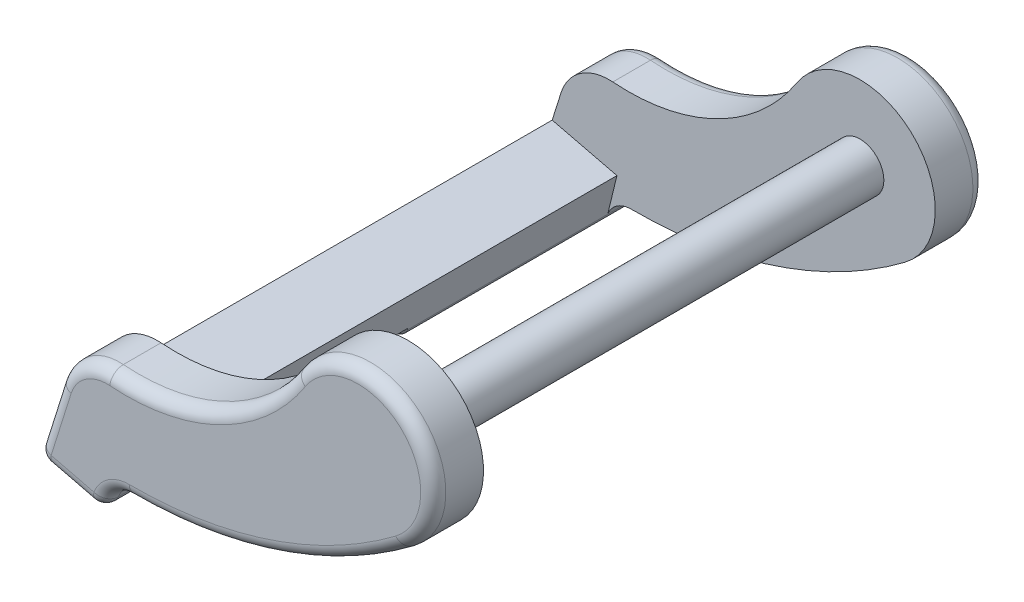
ISO-10303-21;
HEADER;
FILE_DESCRIPTION(('STEP AP214'),'2;1');
FILE_NAME('part.step','',(''),(''),'','','');
FILE_SCHEMA(('AUTOMOTIVE_DESIGN { 1 0 10303 214 1 1 1 1 }'));
ENDSEC;
DATA;
#1=APPLICATION_CONTEXT('core data for automotive mechanical design processes');
#2=APPLICATION_PROTOCOL_DEFINITION('international standard','automotive_design',2000,#1);
#3=PRODUCT_CONTEXT('',#1,'mechanical');
#4=PRODUCT('Part','Part','',(#3));
#5=PRODUCT_RELATED_PRODUCT_CATEGORY('part','',(#4));
#6=PRODUCT_DEFINITION_FORMATION('','',#4);
#7=PRODUCT_DEFINITION_CONTEXT('part definition',#1,'design');
#8=PRODUCT_DEFINITION('design','',#6,#7);
#9=PRODUCT_DEFINITION_SHAPE('','',#8);
#10=(LENGTH_UNIT() NAMED_UNIT(*) SI_UNIT(.MILLI.,.METRE.));
#11=(NAMED_UNIT(*) PLANE_ANGLE_UNIT() SI_UNIT($,.RADIAN.));
#12=(NAMED_UNIT(*) SI_UNIT($,.STERADIAN.) SOLID_ANGLE_UNIT());
#13=UNCERTAINTY_MEASURE_WITH_UNIT(LENGTH_MEASURE(1.E-05),#10,'distance_accuracy_value','');
#14=(GEOMETRIC_REPRESENTATION_CONTEXT(3) GLOBAL_UNCERTAINTY_ASSIGNED_CONTEXT((#13)) GLOBAL_UNIT_ASSIGNED_CONTEXT((#10,
#11,#12)) REPRESENTATION_CONTEXT('',''));
#15=CARTESIAN_POINT('',(0.,0.,0.));
#16=DIRECTION('',(0.,0.,1.));
#17=DIRECTION('',(1.,0.,0.));
#18=AXIS2_PLACEMENT_3D('',#15,#16,#17);
#19=CARTESIAN_POINT('',(-8.18528616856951,-56.520457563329,11.));
#20=DIRECTION('',(0.235824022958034,0.971795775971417,0.));
#21=DIRECTION('',(-0.971795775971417,0.235824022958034,0.));
#22=AXIS2_PLACEMENT_3D('',#19,#20,#21);
#23=PLANE('',#22);
#24=DIRECTION('',(0.971795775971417,-0.235824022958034,0.));
#25=VECTOR('',#24,1.);
#26=CARTESIAN_POINT('',(-8.18528616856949,-56.520457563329,-1.04999999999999));
#27=LINE('',#26,#25);
#28=CARTESIAN_POINT('',(-8.63735528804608,-56.4107547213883,-1.04999999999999));
#29=VERTEX_POINT('',#28);
#30=CARTESIAN_POINT('',(-9.52482309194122,-56.1953944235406,-1.04999999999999));
#31=VERTEX_POINT('',#30);
#32=EDGE_CURVE('E660',#29,#31,#27,.F.);
#33=ORIENTED_EDGE('',*,*,#32,.T.);
#34=CARTESIAN_POINT('',(-9.52482309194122,-56.1953944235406,0.));
#35=DIRECTION('',(0.235824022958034,0.971795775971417,0.));
#36=DIRECTION('',(-0.971795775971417,0.235824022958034,0.));
#37=AXIS2_PLACEMENT_3D('',#34,#35,#36);
#38=CIRCLE('',#37,1.05);
#39=CARTESIAN_POINT('',(-10.3443200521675,-55.9965284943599,-0.625601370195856));
#40=VERTEX_POINT('',#39);
#41=EDGE_CURVE('E658',#31,#40,#38,.T.);
#42=ORIENTED_EDGE('',*,*,#41,.T.);
#43=DIRECTION('',(0.,0.,-1.));
#44=VECTOR('',#43,1.);
#45=CARTESIAN_POINT('',(-10.3443200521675,-55.9965284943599,11.));
#46=LINE('',#45,#44);
#47=CARTESIAN_POINT('',(-10.3443200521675,-55.9965284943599,-10.5));
#48=VERTEX_POINT('',#47);
#49=EDGE_CURVE('E366',#40,#48,#46,.T.);
#50=ORIENTED_EDGE('',*,*,#49,.T.);
#51=DIRECTION('',(0.971795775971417,-0.235824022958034,0.));
#52=VECTOR('',#51,1.);
#53=CARTESIAN_POINT('',(-8.63735528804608,-56.4107547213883,-10.5));
#54=LINE('',#53,#52);
#55=CARTESIAN_POINT('',(-8.63735528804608,-56.4107547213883,-10.5));
#56=VERTEX_POINT('',#55);
#57=EDGE_CURVE('E420',#48,#56,#54,.T.);
#58=ORIENTED_EDGE('',*,*,#57,.T.);
#59=DIRECTION('',(0.,0.,-1.));
#60=VECTOR('',#59,1.);
#61=CARTESIAN_POINT('',(-8.63735528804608,-56.4107547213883,11.));
#62=LINE('',#61,#60);
#63=EDGE_CURVE('E375',#56,#29,#62,.F.);
#64=ORIENTED_EDGE('',*,*,#63,.T.);
#65=EDGE_LOOP('',(#33,#42,#50,#58,#64));
#66=FACE_BOUND('',#65,.T.);
#67=ADVANCED_FACE('F44',(#66),#23,.F.);
#68=CARTESIAN_POINT('',(-8.51944327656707,-55.9248568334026,11.));
#69=DIRECTION('',(0.,0.,-1.));
#70=DIRECTION('',(-1.,0.,0.));
#71=AXIS2_PLACEMENT_3D('',#68,#69,#70);
#72=CYLINDRICAL_SURFACE('',#71,0.5);
#73=DIRECTION('',(0.,0.,-1.));
#74=VECTOR('',#73,1.);
#75=CARTESIAN_POINT('',(-8.05215416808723,-56.1027356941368,11.));
#76=LINE('',#75,#74);
#77=CARTESIAN_POINT('',(-8.05215416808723,-56.1027356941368,-1.04999999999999));
#78=VERTEX_POINT('',#77);
#79=CARTESIAN_POINT('',(-8.05215416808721,-56.1027356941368,-9.));
#80=VERTEX_POINT('',#79);
#81=EDGE_CURVE('E368',#78,#80,#76,.T.);
#82=ORIENTED_EDGE('',*,*,#81,.F.);
#83=CARTESIAN_POINT('',(-8.51944327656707,-55.9248568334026,-1.04999999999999));
#84=DIRECTION('',(0.,0.,-1.));
#85=DIRECTION('',(-1.,0.,0.));
#86=AXIS2_PLACEMENT_3D('',#83,#84,#85);
#87=CIRCLE('',#86,0.5);
#88=EDGE_CURVE('E675',#78,#29,#87,.T.);
#89=ORIENTED_EDGE('',*,*,#88,.T.);
#90=ORIENTED_EDGE('',*,*,#63,.F.);
#91=CARTESIAN_POINT('',(-8.51944327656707,-55.9248568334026,-10.5));
#92=DIRECTION('',(0.,0.,-1.));
#93=DIRECTION('',(-1.,0.,0.));
#94=AXIS2_PLACEMENT_3D('',#91,#92,#93);
#95=CIRCLE('',#94,0.5);
#96=CARTESIAN_POINT('',(-8.05215416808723,-56.1027356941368,-10.5));
#97=VERTEX_POINT('',#96);
#98=EDGE_CURVE('E425',#56,#97,#95,.F.);
#99=ORIENTED_EDGE('',*,*,#98,.T.);
#100=EDGE_CURVE('E365',#80,#97,#76,.T.);
#101=ORIENTED_EDGE('',*,*,#100,.F.);
#102=EDGE_LOOP('',(#82,#89,#90,#99,#101));
#103=FACE_BOUND('',#102,.T.);
#104=ADVANCED_FACE('F593',(#103),#72,.T.);
#105=CARTESIAN_POINT('',(-7.0384318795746,-37.4586582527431,11.));
#106=DIRECTION('',(0.,0.,-1.));
#107=DIRECTION('',(-1.,0.,0.));
#108=AXIS2_PLACEMENT_3D('',#105,#106,#107);
#109=CYLINDRICAL_SURFACE('',#108,18.);
#110=DIRECTION('',(0.,0.,-1.));
#111=VECTOR('',#110,1.);
#112=CARTESIAN_POINT('',(-7.1134104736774,-55.4585020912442,11.));
#113=LINE('',#112,#111);
#114=CARTESIAN_POINT('',(-7.1134104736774,-55.4585020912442,10.5));
#115=VERTEX_POINT('',#114);
#116=CARTESIAN_POINT('',(-7.1134104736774,-55.4585020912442,9.));
#117=VERTEX_POINT('',#116);
#118=EDGE_CURVE('E356',#115,#117,#113,.T.);
#119=ORIENTED_EDGE('',*,*,#118,.T.);
#120=CARTESIAN_POINT('',(-7.0384318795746,-37.4586582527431,9.));
#121=DIRECTION('',(0.,0.,-1.));
#122=DIRECTION('',(-1.,0.,0.));
#123=AXIS2_PLACEMENT_3D('',#120,#121,#122);
#124=CIRCLE('',#123,18.);
#125=CARTESIAN_POINT('',(3.80768637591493,-51.8239538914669,9.));
#126=VERTEX_POINT('',#125);
#127=EDGE_CURVE('E311',#117,#126,#124,.F.);
#128=ORIENTED_EDGE('',*,*,#127,.T.);
#129=DIRECTION('',(0.,0.,-1.));
#130=VECTOR('',#129,1.);
#131=CARTESIAN_POINT('',(3.80768637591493,-51.8239538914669,11.));
#132=LINE('',#131,#130);
#133=CARTESIAN_POINT('',(3.80768637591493,-51.8239538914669,10.5));
#134=VERTEX_POINT('',#133);
#135=EDGE_CURVE('E357',#134,#126,#132,.T.);
#136=ORIENTED_EDGE('',*,*,#135,.F.);
#137=CARTESIAN_POINT('',(-7.0384318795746,-37.4586582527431,10.5));
#138=DIRECTION('',(0.,0.,-1.));
#139=DIRECTION('',(-1.,0.,0.));
#140=AXIS2_PLACEMENT_3D('',#137,#138,#139);
#141=CIRCLE('',#140,18.);
#142=EDGE_CURVE('E379',#134,#115,#141,.T.);
#143=ORIENTED_EDGE('',*,*,#142,.T.);
#144=EDGE_LOOP('',(#119,#128,#136,#143));
#145=FACE_BOUND('',#144,.T.);
#146=ADVANCED_FACE('F584',(#145),#109,.T.);
#147=CARTESIAN_POINT('',(-7.11757595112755,-56.4584934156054,11.));
#148=DIRECTION('',(0.,0.,-1.));
#149=DIRECTION('',(-1.,0.,0.));
#150=AXIS2_PLACEMENT_3D('',#147,#148,#149);
#151=CYLINDRICAL_SURFACE('',#150,1.);
#152=CARTESIAN_POINT('',(-8.05215416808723,-56.1027356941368,10.5));
#153=VERTEX_POINT('',#152);
#154=CARTESIAN_POINT('',(-8.05215416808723,-56.1027356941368,9.));
#155=VERTEX_POINT('',#154);
#156=EDGE_CURVE('E364',#153,#155,#76,.T.);
#157=ORIENTED_EDGE('',*,*,#156,.T.);
#158=CARTESIAN_POINT('',(-7.11757595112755,-56.4584934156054,9.));
#159=DIRECTION('',(0.,0.,1.));
#160=DIRECTION('',(1.,0.,0.));
#161=AXIS2_PLACEMENT_3D('',#158,#159,#160);
#162=CIRCLE('',#161,1.);
#163=EDGE_CURVE('E301',#155,#117,#162,.F.);
#164=ORIENTED_EDGE('',*,*,#163,.T.);
#165=ORIENTED_EDGE('',*,*,#118,.F.);
#166=CARTESIAN_POINT('',(-7.11757595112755,-56.4584934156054,10.5));
#167=DIRECTION('',(0.,0.,-1.));
#168=DIRECTION('',(-1.,0.,0.));
#169=AXIS2_PLACEMENT_3D('',#166,#167,#168);
#170=CIRCLE('',#169,1.);
#171=EDGE_CURVE('E423',#115,#153,#170,.F.);
#172=ORIENTED_EDGE('',*,*,#171,.T.);
#173=EDGE_LOOP('',(#157,#164,#165,#172));
#174=FACE_BOUND('',#173,.T.);
#175=ADVANCED_FACE('F546',(#174),#151,.F.);
#176=CARTESIAN_POINT('',(-7.0384318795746,-37.4586582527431,9.));
#177=DIRECTION('',(0.,0.,-1.));
#178=DIRECTION('',(-1.,0.,0.));
#179=AXIS2_PLACEMENT_3D('',#176,#177,#178);
#180=PLANE('',#179);
#181=CARTESIAN_POINT('',(-8.,-53.4297379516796,9.));
#182=DIRECTION('',(0.,0.,-1.));
#183=DIRECTION('',(-1.,0.,0.));
#184=AXIS2_PLACEMENT_3D('',#181,#182,#183);
#185=CIRCLE('',#184,2.);
#186=CARTESIAN_POINT('',(-7.84767637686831,-51.4355470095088,9.));
#187=VERTEX_POINT('',#186);
#188=CARTESIAN_POINT('',(-9.90797108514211,-52.8300327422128,9.));
#189=VERTEX_POINT('',#188);
#190=EDGE_CURVE('E327',#187,#189,#185,.F.);
#191=ORIENTED_EDGE('',*,*,#190,.F.);
#192=CARTESIAN_POINT('',(-7.23838188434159,-43.4587832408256,9.));
#193=DIRECTION('',(0.,0.,-1.));
#194=DIRECTION('',(-1.,0.,0.));
#195=AXIS2_PLACEMENT_3D('',#192,#193,#194);
#196=CIRCLE('',#195,8.);
#197=CARTESIAN_POINT('',(-0.519558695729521,-47.8012957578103,9.));
#198=VERTEX_POINT('',#197);
#199=EDGE_CURVE('E326',#198,#187,#196,.T.);
#200=ORIENTED_EDGE('',*,*,#199,.F.);
#201=CARTESIAN_POINT('',(2.,-49.4297379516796,9.));
#202=DIRECTION('',(0.,0.,-1.));
#203=DIRECTION('',(-1.,0.,0.));
#204=AXIS2_PLACEMENT_3D('',#201,#202,#203);
#205=CIRCLE('',#204,3.);
#206=EDGE_CURVE('E333',#126,#198,#205,.F.);
#207=ORIENTED_EDGE('',*,*,#206,.F.);
#208=ORIENTED_EDGE('',*,*,#127,.F.);
#209=ORIENTED_EDGE('',*,*,#163,.F.);
#210=DIRECTION('',(-0.235824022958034,-0.971795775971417,0.));
#211=VECTOR('',#210,1.);
#212=CARTESIAN_POINT('',(-5.10949723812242,-43.9764835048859,9.));
#213=LINE('',#212,#211);
#214=CARTESIAN_POINT('',(-7.68364047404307,-54.584145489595,9.));
#215=VERTEX_POINT('',#214);
#216=EDGE_CURVE('E292',#215,#155,#213,.T.);
#217=ORIENTED_EDGE('',*,*,#216,.F.);
#218=DIRECTION('',(0.971795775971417,-0.235824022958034,0.));
#219=VECTOR('',#218,1.);
#220=CARTESIAN_POINT('',(-10.9990095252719,-53.7796105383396,9.));
#221=LINE('',#220,#219);
#222=CARTESIAN_POINT('',(-10.2626069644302,-53.9583120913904,9.));
#223=VERTEX_POINT('',#222);
#224=EDGE_CURVE('E317',#223,#215,#221,.T.);
#225=ORIENTED_EDGE('',*,*,#224,.F.);
#226=DIRECTION('',(-0.299852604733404,-0.953985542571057,0.));
#227=VECTOR('',#226,1.);
#228=CARTESIAN_POINT('',(-5.2529069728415,-38.0198767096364,9.));
#229=LINE('',#228,#227);
#230=EDGE_CURVE('E318',#189,#223,#229,.T.);
#231=ORIENTED_EDGE('',*,*,#230,.F.);
#232=EDGE_LOOP('',(#191,#200,#207,#208,#209,#217,#225,#231));
#233=FACE_BOUND('',#232,.T.);
#234=CARTESIAN_POINT('',(2.,-49.4297379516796,9.));
#235=DIRECTION('',(0.,0.,-1.));
#236=DIRECTION('',(-1.,0.,0.));
#237=AXIS2_PLACEMENT_3D('',#234,#235,#236);
#238=CIRCLE('',#237,0.95);
#239=CARTESIAN_POINT('',(1.05,-49.4297379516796,9.));
#240=VERTEX_POINT('',#239);
#241=EDGE_CURVE('E310',#240,#240,#238,.T.);
#242=ORIENTED_EDGE('',*,*,#241,.F.);
#243=EDGE_LOOP('',(#242));
#244=FACE_BOUND('',#243,.T.);
#245=ADVANCED_FACE('F545',(#233,#244),#180,.T.);
#246=CARTESIAN_POINT('',(-7.0384318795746,-37.4586582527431,-9.));
#247=DIRECTION('',(0.,0.,-1.));
#248=DIRECTION('',(-1.,0.,0.));
#249=AXIS2_PLACEMENT_3D('',#246,#247,#248);
#250=PLANE('',#249);
#251=DIRECTION('',(0.971795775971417,-0.235824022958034,0.));
#252=VECTOR('',#251,1.);
#253=CARTESIAN_POINT('',(-10.9990095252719,-53.7796105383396,-9.));
#254=LINE('',#253,#252);
#255=CARTESIAN_POINT('',(-10.2626069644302,-53.9583120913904,-9.));
#256=VERTEX_POINT('',#255);
#257=CARTESIAN_POINT('',(-7.68364047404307,-54.584145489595,-9.));
#258=VERTEX_POINT('',#257);
#259=EDGE_CURVE('E312',#256,#258,#254,.T.);
#260=ORIENTED_EDGE('',*,*,#259,.T.);
#261=DIRECTION('',(-0.235824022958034,-0.971795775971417,0.));
#262=VECTOR('',#261,1.);
#263=CARTESIAN_POINT('',(-5.10949723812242,-43.9764835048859,-9.));
#264=LINE('',#263,#262);
#265=EDGE_CURVE('E294',#258,#80,#264,.T.);
#266=ORIENTED_EDGE('',*,*,#265,.T.);
#267=CARTESIAN_POINT('',(-7.11757595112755,-56.4584934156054,-9.));
#268=DIRECTION('',(0.,0.,-1.));
#269=DIRECTION('',(-1.,0.,0.));
#270=AXIS2_PLACEMENT_3D('',#267,#268,#269);
#271=CIRCLE('',#270,1.);
#272=CARTESIAN_POINT('',(-7.1134104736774,-55.4585020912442,-9.));
#273=VERTEX_POINT('',#272);
#274=EDGE_CURVE('E302',#273,#80,#271,.F.);
#275=ORIENTED_EDGE('',*,*,#274,.F.);
#276=CARTESIAN_POINT('',(-7.0384318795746,-37.4586582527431,-9.));
#277=DIRECTION('',(0.,0.,-1.));
#278=DIRECTION('',(-1.,0.,0.));
#279=AXIS2_PLACEMENT_3D('',#276,#277,#278);
#280=CIRCLE('',#279,18.);
#281=CARTESIAN_POINT('',(3.80768637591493,-51.8239538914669,-9.));
#282=VERTEX_POINT('',#281);
#283=EDGE_CURVE('E338',#273,#282,#280,.F.);
#284=ORIENTED_EDGE('',*,*,#283,.T.);
#285=CARTESIAN_POINT('',(2.,-49.4297379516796,-9.));
#286=DIRECTION('',(0.,0.,-1.));
#287=DIRECTION('',(-1.,0.,0.));
#288=AXIS2_PLACEMENT_3D('',#285,#286,#287);
#289=CIRCLE('',#288,3.);
#290=CARTESIAN_POINT('',(-0.519558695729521,-47.8012957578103,-9.));
#291=VERTEX_POINT('',#290);
#292=EDGE_CURVE('E336',#282,#291,#289,.F.);
#293=ORIENTED_EDGE('',*,*,#292,.T.);
#294=CARTESIAN_POINT('',(-7.23838188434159,-43.4587832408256,-9.));
#295=DIRECTION('',(0.,0.,-1.));
#296=DIRECTION('',(-1.,0.,0.));
#297=AXIS2_PLACEMENT_3D('',#294,#295,#296);
#298=CIRCLE('',#297,8.);
#299=CARTESIAN_POINT('',(-7.84767637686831,-51.4355470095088,-9.));
#300=VERTEX_POINT('',#299);
#301=EDGE_CURVE('E341',#291,#300,#298,.T.);
#302=ORIENTED_EDGE('',*,*,#301,.T.);
#303=CARTESIAN_POINT('',(-8.,-53.4297379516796,-9.));
#304=DIRECTION('',(0.,0.,-1.));
#305=DIRECTION('',(-1.,0.,0.));
#306=AXIS2_PLACEMENT_3D('',#303,#304,#305);
#307=CIRCLE('',#306,2.);
#308=CARTESIAN_POINT('',(-9.90797108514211,-52.8300327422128,-9.));
#309=VERTEX_POINT('',#308);
#310=EDGE_CURVE('E343',#300,#309,#307,.F.);
#311=ORIENTED_EDGE('',*,*,#310,.T.);
#312=DIRECTION('',(-0.299852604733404,-0.953985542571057,0.));
#313=VECTOR('',#312,1.);
#314=CARTESIAN_POINT('',(-5.2529069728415,-38.0198767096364,-9.));
#315=LINE('',#314,#313);
#316=EDGE_CURVE('E313',#309,#256,#315,.T.);
#317=ORIENTED_EDGE('',*,*,#316,.T.);
#318=EDGE_LOOP('',(#260,#266,#275,#284,#293,#302,#311,#317));
#319=FACE_BOUND('',#318,.T.);
#320=CARTESIAN_POINT('',(2.,-49.4297379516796,-9.));
#321=DIRECTION('',(0.,0.,-1.));
#322=DIRECTION('',(-1.,0.,0.));
#323=AXIS2_PLACEMENT_3D('',#320,#321,#322);
#324=CIRCLE('',#323,0.95);
#325=CARTESIAN_POINT('',(1.05,-49.4297379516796,-9.));
#326=VERTEX_POINT('',#325);
#327=EDGE_CURVE('E453',#326,#326,#324,.F.);
#328=ORIENTED_EDGE('',*,*,#327,.F.);
#329=EDGE_LOOP('',(#328));
#330=FACE_BOUND('',#329,.T.);
#331=ADVANCED_FACE('F543',(#319,#330),#250,.F.);
#332=ORIENTED_EDGE('',*,*,#283,.F.);
#333=CARTESIAN_POINT('',(-7.1134104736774,-55.4585020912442,-10.5));
#334=VERTEX_POINT('',#333);
#335=EDGE_CURVE('E359',#273,#334,#113,.T.);
#336=ORIENTED_EDGE('',*,*,#335,.T.);
#337=CARTESIAN_POINT('',(-7.0384318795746,-37.4586582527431,-10.5));
#338=DIRECTION('',(0.,0.,-1.));
#339=DIRECTION('',(-1.,0.,0.));
#340=AXIS2_PLACEMENT_3D('',#337,#338,#339);
#341=CIRCLE('',#340,18.);
#342=CARTESIAN_POINT('',(3.80768637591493,-51.8239538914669,-10.5));
#343=VERTEX_POINT('',#342);
#344=EDGE_CURVE('E382',#334,#343,#341,.F.);
#345=ORIENTED_EDGE('',*,*,#344,.T.);
#346=EDGE_CURVE('E354',#282,#343,#132,.T.);
#347=ORIENTED_EDGE('',*,*,#346,.F.);
#348=EDGE_LOOP('',(#332,#336,#345,#347));
#349=FACE_BOUND('',#348,.T.);
#350=ADVANCED_FACE('F549',(#349),#109,.T.);
#351=CARTESIAN_POINT('',(2.,-49.4297379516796,11.));
#352=DIRECTION('',(0.,0.,-1.));
#353=DIRECTION('',(-1.,0.,0.));
#354=AXIS2_PLACEMENT_3D('',#351,#352,#353);
#355=CYLINDRICAL_SURFACE('',#354,3.);
#356=ORIENTED_EDGE('',*,*,#346,.T.);
#357=CARTESIAN_POINT('',(2.,-49.4297379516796,-10.5));
#358=DIRECTION('',(0.,0.,-1.));
#359=DIRECTION('',(-1.,0.,0.));
#360=AXIS2_PLACEMENT_3D('',#357,#358,#359);
#361=CIRCLE('',#360,3.);
#362=CARTESIAN_POINT('',(-0.519558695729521,-47.8012957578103,-10.5));
#363=VERTEX_POINT('',#362);
#364=EDGE_CURVE('E399',#343,#363,#361,.F.);
#365=ORIENTED_EDGE('',*,*,#364,.T.);
#366=DIRECTION('',(0.,0.,-1.));
#367=VECTOR('',#366,1.);
#368=CARTESIAN_POINT('',(-0.519558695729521,-47.8012957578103,11.));
#369=LINE('',#368,#367);
#370=EDGE_CURVE('E355',#291,#363,#369,.T.);
#371=ORIENTED_EDGE('',*,*,#370,.F.);
#372=ORIENTED_EDGE('',*,*,#292,.F.);
#373=EDGE_LOOP('',(#356,#365,#371,#372));
#374=FACE_BOUND('',#373,.T.);
#375=ADVANCED_FACE('F581',(#374),#355,.T.);
#376=CARTESIAN_POINT('',(-7.23838188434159,-43.4587832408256,11.));
#377=DIRECTION('',(0.,0.,-1.));
#378=DIRECTION('',(-1.,0.,0.));
#379=AXIS2_PLACEMENT_3D('',#376,#377,#378);
#380=CYLINDRICAL_SURFACE('',#379,8.);
#381=ORIENTED_EDGE('',*,*,#370,.T.);
#382=CARTESIAN_POINT('',(-7.23838188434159,-43.4587832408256,-10.5));
#383=DIRECTION('',(0.,0.,-1.));
#384=DIRECTION('',(-1.,0.,0.));
#385=AXIS2_PLACEMENT_3D('',#382,#383,#384);
#386=CIRCLE('',#385,8.);
#387=CARTESIAN_POINT('',(-7.84767637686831,-51.4355470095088,-10.5));
#388=VERTEX_POINT('',#387);
#389=EDGE_CURVE('E401',#363,#388,#386,.T.);
#390=ORIENTED_EDGE('',*,*,#389,.T.);
#391=DIRECTION('',(0.,0.,-1.));
#392=VECTOR('',#391,1.);
#393=CARTESIAN_POINT('',(-7.84767637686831,-51.4355470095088,11.));
#394=LINE('',#393,#392);
#395=EDGE_CURVE('E348',#300,#388,#394,.T.);
#396=ORIENTED_EDGE('',*,*,#395,.F.);
#397=ORIENTED_EDGE('',*,*,#301,.F.);
#398=EDGE_LOOP('',(#381,#390,#396,#397));
#399=FACE_BOUND('',#398,.T.);
#400=ADVANCED_FACE('F580',(#399),#380,.F.);
#401=CARTESIAN_POINT('',(-8.,-53.4297379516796,11.));
#402=DIRECTION('',(0.,0.,-1.));
#403=DIRECTION('',(-1.,0.,0.));
#404=AXIS2_PLACEMENT_3D('',#401,#402,#403);
#405=CYLINDRICAL_SURFACE('',#404,2.);
#406=ORIENTED_EDGE('',*,*,#395,.T.);
#407=CARTESIAN_POINT('',(-8.,-53.4297379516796,-10.5));
#408=DIRECTION('',(0.,0.,-1.));
#409=DIRECTION('',(-1.,0.,0.));
#410=AXIS2_PLACEMENT_3D('',#407,#408,#409);
#411=CIRCLE('',#410,2.);
#412=CARTESIAN_POINT('',(-9.90797108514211,-52.8300327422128,-10.5));
#413=VERTEX_POINT('',#412);
#414=EDGE_CURVE('E403',#388,#413,#411,.F.);
#415=ORIENTED_EDGE('',*,*,#414,.T.);
#416=DIRECTION('',(0.,0.,-1.));
#417=VECTOR('',#416,1.);
#418=CARTESIAN_POINT('',(-9.90797108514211,-52.8300327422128,11.));
#419=LINE('',#418,#417);
#420=EDGE_CURVE('E323',#309,#413,#419,.T.);
#421=ORIENTED_EDGE('',*,*,#420,.F.);
#422=ORIENTED_EDGE('',*,*,#310,.F.);
#423=EDGE_LOOP('',(#406,#415,#421,#422));
#424=FACE_BOUND('',#423,.T.);
#425=ADVANCED_FACE('F570',(#424),#405,.T.);
#426=CARTESIAN_POINT('',(-10.8636395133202,-55.8705061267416,11.));
#427=DIRECTION('',(0.953985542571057,-0.299852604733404,0.));
#428=DIRECTION('',(0.299852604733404,0.953985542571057,0.));
#429=AXIS2_PLACEMENT_3D('',#426,#427,#428);
#430=PLANE('',#429);
#431=ORIENTED_EDGE('',*,*,#420,.T.);
#432=DIRECTION('',(-0.299852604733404,-0.953985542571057,0.));
#433=VECTOR('',#432,1.);
#434=CARTESIAN_POINT('',(-10.703400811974,-55.3607043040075,-10.5));
#435=LINE('',#434,#433);
#436=CARTESIAN_POINT('',(-10.703400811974,-55.3607043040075,-10.5));
#437=VERTEX_POINT('',#436);
#438=EDGE_CURVE('E410',#413,#437,#435,.T.);
#439=ORIENTED_EDGE('',*,*,#438,.T.);
#440=DIRECTION('',(0.,0.,-1.));
#441=VECTOR('',#440,1.);
#442=CARTESIAN_POINT('',(-10.703400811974,-55.3607043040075,11.));
#443=LINE('',#442,#441);
#444=CARTESIAN_POINT('',(-10.703400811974,-55.3607043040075,10.5));
#445=VERTEX_POINT('',#444);
#446=EDGE_CURVE('E377',#437,#445,#443,.F.);
#447=ORIENTED_EDGE('',*,*,#446,.T.);
#448=DIRECTION('',(-0.299852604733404,-0.953985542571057,0.));
#449=VECTOR('',#448,1.);
#450=CARTESIAN_POINT('',(-10.8636395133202,-55.8705061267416,10.5));
#451=LINE('',#450,#449);
#452=CARTESIAN_POINT('',(-9.90797108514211,-52.8300327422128,10.5));
#453=VERTEX_POINT('',#452);
#454=EDGE_CURVE('E404',#445,#453,#451,.F.);
#455=ORIENTED_EDGE('',*,*,#454,.T.);
#456=EDGE_CURVE('E346',#453,#189,#419,.T.);
#457=ORIENTED_EDGE('',*,*,#456,.T.);
#458=ORIENTED_EDGE('',*,*,#230,.T.);
#459=DIRECTION('',(0.,0.,-1.));
#460=VECTOR('',#459,1.);
#461=CARTESIAN_POINT('',(-10.2626069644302,-53.9583120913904,11.));
#462=LINE('',#461,#460);
#463=EDGE_CURVE('E319',#223,#256,#462,.T.);
#464=ORIENTED_EDGE('',*,*,#463,.T.);
#465=ORIENTED_EDGE('',*,*,#316,.F.);
#466=EDGE_LOOP('',(#431,#439,#447,#455,#457,#458,#464,#465));
#467=FACE_BOUND('',#466,.T.);
#468=ADVANCED_FACE('F564',(#467),#430,.F.);
#469=CARTESIAN_POINT('',(-0.519558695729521,-47.8012957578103,10.5));
#470=VERTEX_POINT('',#469);
#471=EDGE_CURVE('E352',#470,#198,#369,.T.);
#472=ORIENTED_EDGE('',*,*,#471,.F.);
#473=CARTESIAN_POINT('',(2.,-49.4297379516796,10.5));
#474=DIRECTION('',(0.,0.,-1.));
#475=DIRECTION('',(-1.,0.,0.));
#476=AXIS2_PLACEMENT_3D('',#473,#474,#475);
#477=CIRCLE('',#476,3.);
#478=EDGE_CURVE('E446',#470,#134,#477,.T.);
#479=ORIENTED_EDGE('',*,*,#478,.T.);
#480=ORIENTED_EDGE('',*,*,#135,.T.);
#481=ORIENTED_EDGE('',*,*,#206,.T.);
#482=EDGE_LOOP('',(#472,#479,#480,#481));
#483=FACE_BOUND('',#482,.T.);
#484=ADVANCED_FACE('F569',(#483),#355,.T.);
#485=CARTESIAN_POINT('',(-7.84767637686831,-51.4355470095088,10.5));
#486=VERTEX_POINT('',#485);
#487=EDGE_CURVE('E347',#486,#187,#394,.T.);
#488=ORIENTED_EDGE('',*,*,#487,.F.);
#489=CARTESIAN_POINT('',(-7.23838188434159,-43.4587832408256,10.5));
#490=DIRECTION('',(0.,0.,-1.));
#491=DIRECTION('',(-1.,0.,0.));
#492=AXIS2_PLACEMENT_3D('',#489,#490,#491);
#493=CIRCLE('',#492,8.);
#494=EDGE_CURVE('E449',#486,#470,#493,.F.);
#495=ORIENTED_EDGE('',*,*,#494,.T.);
#496=ORIENTED_EDGE('',*,*,#471,.T.);
#497=ORIENTED_EDGE('',*,*,#199,.T.);
#498=EDGE_LOOP('',(#488,#495,#496,#497));
#499=FACE_BOUND('',#498,.T.);
#500=ADVANCED_FACE('F572',(#499),#380,.F.);
#501=ORIENTED_EDGE('',*,*,#456,.F.);
#502=CARTESIAN_POINT('',(-8.,-53.4297379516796,10.5));
#503=DIRECTION('',(0.,0.,-1.));
#504=DIRECTION('',(-1.,0.,0.));
#505=AXIS2_PLACEMENT_3D('',#502,#503,#504);
#506=CIRCLE('',#505,2.);
#507=EDGE_CURVE('E441',#453,#486,#506,.T.);
#508=ORIENTED_EDGE('',*,*,#507,.T.);
#509=ORIENTED_EDGE('',*,*,#487,.T.);
#510=ORIENTED_EDGE('',*,*,#190,.T.);
#511=EDGE_LOOP('',(#501,#508,#509,#510));
#512=FACE_BOUND('',#511,.T.);
#513=ADVANCED_FACE('F565',(#512),#405,.T.);
#514=CARTESIAN_POINT('',(-9.52482309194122,-56.1953944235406,0.));
#515=DIRECTION('',(0.235824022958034,0.971795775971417,0.));
#516=DIRECTION('',(-0.971795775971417,0.235824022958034,0.));
#517=AXIS2_PLACEMENT_3D('',#514,#515,#516);
#518=CIRCLE('',#517,1.05);
#519=CARTESIAN_POINT('',(-10.3443200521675,-55.9965284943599,0.62560137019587));
#520=VERTEX_POINT('',#519);
#521=CARTESIAN_POINT('',(-9.52482309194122,-56.1953944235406,1.05000000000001));
#522=VERTEX_POINT('',#521);
#523=EDGE_CURVE('E717',#520,#522,#518,.T.);
#524=ORIENTED_EDGE('',*,*,#523,.T.);
#525=DIRECTION('',(-0.971795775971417,0.235824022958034,0.));
#526=VECTOR('',#525,1.);
#527=CARTESIAN_POINT('',(-8.1852861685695,-56.520457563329,1.05000000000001));
#528=LINE('',#527,#526);
#529=CARTESIAN_POINT('',(-8.63735528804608,-56.4107547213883,1.05000000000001));
#530=VERTEX_POINT('',#529);
#531=EDGE_CURVE('E714',#522,#530,#528,.F.);
#532=ORIENTED_EDGE('',*,*,#531,.T.);
#533=CARTESIAN_POINT('',(-8.63735528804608,-56.4107547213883,10.5));
#534=VERTEX_POINT('',#533);
#535=EDGE_CURVE('E374',#530,#534,#62,.F.);
#536=ORIENTED_EDGE('',*,*,#535,.T.);
#537=DIRECTION('',(0.971795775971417,-0.235824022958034,0.));
#538=VECTOR('',#537,1.);
#539=CARTESIAN_POINT('',(-8.18528616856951,-56.520457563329,10.5));
#540=LINE('',#539,#538);
#541=CARTESIAN_POINT('',(-10.3443200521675,-55.9965284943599,10.5));
#542=VERTEX_POINT('',#541);
#543=EDGE_CURVE('E414',#534,#542,#540,.F.);
#544=ORIENTED_EDGE('',*,*,#543,.T.);
#545=EDGE_CURVE('E367',#542,#520,#46,.T.);
#546=ORIENTED_EDGE('',*,*,#545,.T.);
#547=EDGE_LOOP('',(#524,#532,#536,#544,#546));
#548=FACE_BOUND('',#547,.T.);
#549=ADVANCED_FACE('F553',(#548),#23,.F.);
#550=CARTESIAN_POINT('',(-7.0384318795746,-37.4586582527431,11.));
#551=DIRECTION('',(0.,0.,-1.));
#552=DIRECTION('',(-1.,0.,0.));
#553=AXIS2_PLACEMENT_3D('',#550,#551,#552);
#554=PLANE('',#553);
#555=CARTESIAN_POINT('',(-8.,-53.4297379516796,11.));
#556=DIRECTION('',(0.,0.,-1.));
#557=DIRECTION('',(-1.,0.,0.));
#558=AXIS2_PLACEMENT_3D('',#555,#556,#557);
#559=CIRCLE('',#558,1.5);
#560=CARTESIAN_POINT('',(-7.88575728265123,-51.9340947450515,11.));
#561=VERTEX_POINT('',#560);
#562=CARTESIAN_POINT('',(-9.43097831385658,-52.9799590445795,11.));
#563=VERTEX_POINT('',#562);
#564=EDGE_CURVE('E438',#561,#563,#559,.F.);
#565=ORIENTED_EDGE('',*,*,#564,.T.);
#566=DIRECTION('',(-0.299852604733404,-0.953985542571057,0.));
#567=VECTOR('',#566,1.);
#568=CARTESIAN_POINT('',(-4.77591420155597,-38.1698030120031,11.));
#569=LINE('',#568,#567);
#570=CARTESIAN_POINT('',(-10.2264080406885,-55.5106306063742,11.));
#571=VERTEX_POINT('',#570);
#572=EDGE_CURVE('E445',#563,#571,#569,.T.);
#573=ORIENTED_EDGE('',*,*,#572,.T.);
#574=DIRECTION('',(0.971795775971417,-0.235824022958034,0.));
#575=VECTOR('',#574,1.);
#576=CARTESIAN_POINT('',(-11.352745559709,-55.2373042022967,11.));
#577=LINE('',#576,#575);
#578=CARTESIAN_POINT('',(-8.51944327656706,-55.9248568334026,11.));
#579=VERTEX_POINT('',#578);
#580=EDGE_CURVE('E429',#571,#579,#577,.T.);
#581=ORIENTED_EDGE('',*,*,#580,.T.);
#582=CARTESIAN_POINT('',(-7.11757595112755,-56.4584934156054,11.));
#583=DIRECTION('',(0.,0.,-1.));
#584=DIRECTION('',(-1.,0.,0.));
#585=AXIS2_PLACEMENT_3D('',#582,#583,#584);
#586=CIRCLE('',#585,1.5);
#587=CARTESIAN_POINT('',(-7.11132773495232,-54.9585064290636,11.));
#588=VERTEX_POINT('',#587);
#589=EDGE_CURVE('E434',#579,#588,#586,.T.);
#590=ORIENTED_EDGE('',*,*,#589,.T.);
#591=CARTESIAN_POINT('',(-7.0384318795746,-37.4586582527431,11.));
#592=DIRECTION('',(0.,0.,-1.));
#593=DIRECTION('',(-1.,0.,0.));
#594=AXIS2_PLACEMENT_3D('',#591,#592,#593);
#595=CIRCLE('',#594,17.5);
#596=CARTESIAN_POINT('',(3.50640531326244,-51.4249179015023,11.));
#597=VERTEX_POINT('',#596);
#598=EDGE_CURVE('E431',#588,#597,#595,.F.);
#599=ORIENTED_EDGE('',*,*,#598,.T.);
#600=CARTESIAN_POINT('',(2.,-49.4297379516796,11.));
#601=DIRECTION('',(0.,0.,-1.));
#602=DIRECTION('',(-1.,0.,0.));
#603=AXIS2_PLACEMENT_3D('',#600,#601,#602);
#604=CIRCLE('',#603,2.5);
#605=CARTESIAN_POINT('',(-0.0996322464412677,-48.0727027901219,11.));
#606=VERTEX_POINT('',#605);
#607=EDGE_CURVE('E437',#597,#606,#604,.F.);
#608=ORIENTED_EDGE('',*,*,#607,.T.);
#609=CARTESIAN_POINT('',(-7.23838188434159,-43.4587832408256,11.));
#610=DIRECTION('',(0.,0.,-1.));
#611=DIRECTION('',(-1.,0.,0.));
#612=AXIS2_PLACEMENT_3D('',#609,#610,#611);
#613=CIRCLE('',#612,8.5);
#614=EDGE_CURVE('E436',#606,#561,#613,.T.);
#615=ORIENTED_EDGE('',*,*,#614,.T.);
#616=EDGE_LOOP('',(#565,#573,#581,#590,#599,#608,#615));
#617=FACE_BOUND('',#616,.T.);
#618=ADVANCED_FACE('F554',(#617),#554,.F.);
#619=CARTESIAN_POINT('',(-7.0384318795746,-37.4586582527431,-11.));
#620=DIRECTION('',(0.,0.,-1.));
#621=DIRECTION('',(-1.,0.,0.));
#622=AXIS2_PLACEMENT_3D('',#619,#620,#621);
#623=PLANE('',#622);
#624=CARTESIAN_POINT('',(2.,-49.4297379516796,-11.));
#625=DIRECTION('',(0.,0.,-1.));
#626=DIRECTION('',(-1.,0.,0.));
#627=AXIS2_PLACEMENT_3D('',#624,#625,#626);
#628=CIRCLE('',#627,2.5);
#629=CARTESIAN_POINT('',(-0.0996322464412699,-48.0727027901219,-11.));
#630=VERTEX_POINT('',#629);
#631=CARTESIAN_POINT('',(3.50640531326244,-51.4249179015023,-11.));
#632=VERTEX_POINT('',#631);
#633=EDGE_CURVE('E395',#630,#632,#628,.T.);
#634=ORIENTED_EDGE('',*,*,#633,.T.);
#635=CARTESIAN_POINT('',(-7.0384318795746,-37.4586582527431,-11.));
#636=DIRECTION('',(0.,0.,-1.));
#637=DIRECTION('',(-1.,0.,0.));
#638=AXIS2_PLACEMENT_3D('',#635,#636,#637);
#639=CIRCLE('',#638,17.5);
#640=CARTESIAN_POINT('',(-7.11132773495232,-54.9585064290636,-11.));
#641=VERTEX_POINT('',#640);
#642=EDGE_CURVE('E398',#632,#641,#639,.T.);
#643=ORIENTED_EDGE('',*,*,#642,.T.);
#644=CARTESIAN_POINT('',(-7.11757595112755,-56.4584934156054,-11.));
#645=DIRECTION('',(0.,0.,-1.));
#646=DIRECTION('',(-1.,0.,0.));
#647=AXIS2_PLACEMENT_3D('',#644,#645,#646);
#648=CIRCLE('',#647,1.5);
#649=CARTESIAN_POINT('',(-8.51944327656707,-55.9248568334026,-11.));
#650=VERTEX_POINT('',#649);
#651=EDGE_CURVE('E384',#641,#650,#648,.F.);
#652=ORIENTED_EDGE('',*,*,#651,.T.);
#653=DIRECTION('',(0.971795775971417,-0.235824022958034,0.));
#654=VECTOR('',#653,1.);
#655=CARTESIAN_POINT('',(-10.2264080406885,-55.5106306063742,-11.));
#656=LINE('',#655,#654);
#657=CARTESIAN_POINT('',(-10.2264080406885,-55.5106306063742,-11.));
#658=VERTEX_POINT('',#657);
#659=EDGE_CURVE('E387',#650,#658,#656,.F.);
#660=ORIENTED_EDGE('',*,*,#659,.T.);
#661=DIRECTION('',(-0.299852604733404,-0.953985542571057,0.));
#662=VECTOR('',#661,1.);
#663=CARTESIAN_POINT('',(-9.43097831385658,-52.9799590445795,-11.));
#664=LINE('',#663,#662);
#665=CARTESIAN_POINT('',(-9.43097831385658,-52.9799590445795,-11.));
#666=VERTEX_POINT('',#665);
#667=EDGE_CURVE('E390',#658,#666,#664,.F.);
#668=ORIENTED_EDGE('',*,*,#667,.T.);
#669=CARTESIAN_POINT('',(-8.,-53.4297379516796,-11.));
#670=DIRECTION('',(0.,0.,-1.));
#671=DIRECTION('',(-1.,0.,0.));
#672=AXIS2_PLACEMENT_3D('',#669,#670,#671);
#673=CIRCLE('',#672,1.5);
#674=CARTESIAN_POINT('',(-7.88575728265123,-51.9340947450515,-11.));
#675=VERTEX_POINT('',#674);
#676=EDGE_CURVE('E388',#666,#675,#673,.T.);
#677=ORIENTED_EDGE('',*,*,#676,.T.);
#678=CARTESIAN_POINT('',(-7.23838188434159,-43.4587832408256,-11.));
#679=DIRECTION('',(0.,0.,-1.));
#680=DIRECTION('',(-1.,0.,0.));
#681=AXIS2_PLACEMENT_3D('',#678,#679,#680);
#682=CIRCLE('',#681,8.5);
#683=EDGE_CURVE('E392',#675,#630,#682,.F.);
#684=ORIENTED_EDGE('',*,*,#683,.T.);
#685=EDGE_LOOP('',(#634,#643,#652,#660,#668,#677,#684));
#686=FACE_BOUND('',#685,.T.);
#687=ADVANCED_FACE('F538',(#686),#623,.T.);
#688=CARTESIAN_POINT('',(-7.71363812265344,-54.5768660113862,11.));
#689=DIRECTION('',(0.235824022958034,0.971795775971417,0.));
#690=DIRECTION('',(-0.971795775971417,0.235824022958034,0.));
#691=AXIS2_PLACEMENT_3D('',#688,#689,#690);
#692=PLANE('',#691);
#693=DIRECTION('',(0.,0.,1.));
#694=VECTOR('',#693,1.);
#695=CARTESIAN_POINT('',(-7.68364047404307,-54.584145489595,11.));
#696=LINE('',#695,#694);
#697=EDGE_CURVE('E299',#258,#215,#696,.T.);
#698=ORIENTED_EDGE('',*,*,#697,.F.);
#699=ORIENTED_EDGE('',*,*,#259,.F.);
#700=ORIENTED_EDGE('',*,*,#463,.F.);
#701=ORIENTED_EDGE('',*,*,#224,.T.);
#702=EDGE_LOOP('',(#698,#699,#700,#701));
#703=FACE_BOUND('',#702,.T.);
#704=ADVANCED_FACE('F537',(#703),#692,.T.);
#705=ORIENTED_EDGE('',*,*,#335,.F.);
#706=ORIENTED_EDGE('',*,*,#274,.T.);
#707=ORIENTED_EDGE('',*,*,#100,.T.);
#708=CARTESIAN_POINT('',(-7.11757595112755,-56.4584934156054,-10.5));
#709=DIRECTION('',(0.,0.,-1.));
#710=DIRECTION('',(-1.,0.,0.));
#711=AXIS2_PLACEMENT_3D('',#708,#709,#710);
#712=CIRCLE('',#711,1.);
#713=EDGE_CURVE('E430',#97,#334,#712,.T.);
#714=ORIENTED_EDGE('',*,*,#713,.T.);
#715=EDGE_LOOP('',(#705,#706,#707,#714));
#716=FACE_BOUND('',#715,.T.);
#717=ADVANCED_FACE('F536',(#716),#151,.F.);
#718=ORIENTED_EDGE('',*,*,#535,.F.);
#719=CARTESIAN_POINT('',(-8.51944327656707,-55.9248568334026,1.05000000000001));
#720=DIRECTION('',(0.,0.,1.));
#721=DIRECTION('',(1.,0.,0.));
#722=AXIS2_PLACEMENT_3D('',#719,#720,#721);
#723=CIRCLE('',#722,0.5);
#724=CARTESIAN_POINT('',(-8.05215416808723,-56.1027356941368,1.05000000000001));
#725=VERTEX_POINT('',#724);
#726=EDGE_CURVE('E509',#530,#725,#723,.T.);
#727=ORIENTED_EDGE('',*,*,#726,.T.);
#728=EDGE_CURVE('E370',#155,#725,#76,.T.);
#729=ORIENTED_EDGE('',*,*,#728,.F.);
#730=ORIENTED_EDGE('',*,*,#156,.F.);
#731=CARTESIAN_POINT('',(-8.51944327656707,-55.9248568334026,10.5));
#732=DIRECTION('',(0.,0.,-1.));
#733=DIRECTION('',(-1.,0.,0.));
#734=AXIS2_PLACEMENT_3D('',#731,#732,#733);
#735=CIRCLE('',#734,0.5);
#736=EDGE_CURVE('E416',#153,#534,#735,.T.);
#737=ORIENTED_EDGE('',*,*,#736,.T.);
#738=EDGE_LOOP('',(#718,#727,#729,#730,#737));
#739=FACE_BOUND('',#738,.T.);
#740=ADVANCED_FACE('F588',(#739),#72,.T.);
#741=CARTESIAN_POINT('',(-10.2264080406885,-55.5106306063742,11.));
#742=DIRECTION('',(0.,0.,-1.));
#743=DIRECTION('',(-1.,0.,0.));
#744=AXIS2_PLACEMENT_3D('',#741,#742,#743);
#745=CYLINDRICAL_SURFACE('',#744,0.5);
#746=ORIENTED_EDGE('',*,*,#49,.F.);
#747=CARTESIAN_POINT('',(-10.1188420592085,-55.9243385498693,-0.700984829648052));
#748=CARTESIAN_POINT('',(-10.120417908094,-55.9586415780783,-0.706983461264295));
#749=CARTESIAN_POINT('',(-10.1358655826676,-55.9820620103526,-0.727672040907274));
#750=CARTESIAN_POINT('',(-10.1513132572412,-56.0054824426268,-0.748360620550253));
#751=CARTESIAN_POINT('',(-10.1739377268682,-56.0078698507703,-0.774772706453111));
#752=CARTESIAN_POINT('',(-10.1423484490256,-55.927565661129,-0.680839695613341));
#753=CARTESIAN_POINT('',(-10.1457556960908,-55.9629285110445,-0.685834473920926));
#754=CARTESIAN_POINT('',(-10.1636384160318,-55.9865127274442,-0.706124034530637));
#755=CARTESIAN_POINT('',(-10.181724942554,-56.0101171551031,-0.726265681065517));
#756=CARTESIAN_POINT('',(-10.2061443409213,-56.0112185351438,-0.752507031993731));
#757=CARTESIAN_POINT('',(-10.1645529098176,-55.9281943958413,-0.659275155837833));
#758=CARTESIAN_POINT('',(-10.1695084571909,-55.9645492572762,-0.663246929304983));
#759=CARTESIAN_POINT('',(-10.1898746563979,-55.9881627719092,-0.683047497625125));
#760=CARTESIAN_POINT('',(-10.2104312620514,-56.0117715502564,-0.702664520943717));
#761=CARTESIAN_POINT('',(-10.2366401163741,-56.0113394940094,-0.728672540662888));
#762=CARTESIAN_POINT('',(-10.2058862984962,-55.9256756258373,-0.614086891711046));
#763=CARTESIAN_POINT('',(-10.2135591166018,-55.9639958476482,-0.616027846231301));
#764=CARTESIAN_POINT('',(-10.2387199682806,-55.9874109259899,-0.634743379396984));
#765=CARTESIAN_POINT('',(-10.2640494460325,-56.0108252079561,-0.653287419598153));
#766=CARTESIAN_POINT('',(-10.2935189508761,-56.0069262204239,-0.678727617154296));
#767=CARTESIAN_POINT('',(-10.2250458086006,-55.9225687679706,-0.590487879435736));
#768=CARTESIAN_POINT('',(-10.2338954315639,-55.9618345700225,-0.591375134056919));
#769=CARTESIAN_POINT('',(-10.2613651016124,-55.9850525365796,-0.609541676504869));
#770=CARTESIAN_POINT('',(-10.2890066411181,-56.0082387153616,-0.627489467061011));
#771=CARTESIAN_POINT('',(-10.3199428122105,-56.0024421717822,-0.652644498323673));
#772=CARTESIAN_POINT('',(-10.2691148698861,-55.9118784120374,-0.529377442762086));
#773=CARTESIAN_POINT('',(-10.2805500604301,-55.9535583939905,-0.527650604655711));
#774=CARTESIAN_POINT('',(-10.3134652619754,-55.9760737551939,-0.54442782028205));
#775=CARTESIAN_POINT('',(-10.3467753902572,-55.9985243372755,-0.560717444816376));
#776=CARTESIAN_POINT('',(-10.3808275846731,-55.9876721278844,-0.585101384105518));
#777=CARTESIAN_POINT('',(-10.2921415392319,-55.9028366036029,-0.490786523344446));
#778=CARTESIAN_POINT('',(-10.3046220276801,-55.9459753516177,-0.487614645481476));
#779=CARTESIAN_POINT('',(-10.3407017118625,-55.9679165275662,-0.503435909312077));
#780=CARTESIAN_POINT('',(-10.3770941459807,-55.9897372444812,-0.518689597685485));
#781=CARTESIAN_POINT('',(-10.4127448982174,-55.9756093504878,-0.542448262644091));
#782=CARTESIAN_POINT('',(-10.3318389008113,-55.8830332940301,-0.410577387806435));
#783=CARTESIAN_POINT('',(-10.345807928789,-55.9292378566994,-0.405143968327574));
#784=CARTESIAN_POINT('',(-10.3876531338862,-55.949840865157,-0.41879340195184));
#785=CARTESIAN_POINT('',(-10.4298239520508,-55.9703185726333,-0.431859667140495));
#786=CARTESIAN_POINT('',(-10.4678966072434,-55.9495132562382,-0.453796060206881));
#787=CARTESIAN_POINT('',(-10.3484671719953,-55.872260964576,-0.368941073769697));
#788=CARTESIAN_POINT('',(-10.3627733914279,-55.9200535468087,-0.362671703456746));
#789=CARTESIAN_POINT('',(-10.4073179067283,-55.939911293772,-0.375127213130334));
#790=CARTESIAN_POINT('',(-10.4520654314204,-55.9596519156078,-0.387012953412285));
#791=CARTESIAN_POINT('',(-10.4910730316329,-55.9354676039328,-0.407776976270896));
#792=CARTESIAN_POINT('',(-10.3765006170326,-55.851477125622,-0.281009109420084));
#793=CARTESIAN_POINT('',(-10.391133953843,-55.902455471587,-0.27399866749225));
#794=CARTESIAN_POINT('',(-10.4404257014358,-55.9208581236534,-0.283833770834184));
#795=CARTESIAN_POINT('',(-10.4899501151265,-55.9391271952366,-0.293037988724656));
#796=CARTESIAN_POINT('',(-10.5302250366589,-55.9084903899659,-0.310589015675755));
#797=CARTESIAN_POINT('',(-10.3875576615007,-55.8415429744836,-0.23458311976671));
#798=CARTESIAN_POINT('',(-10.40201967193,-55.8941619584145,-0.227848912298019));
#799=CARTESIAN_POINT('',(-10.4534544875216,-55.9118117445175,-0.236122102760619));
#800=CARTESIAN_POINT('',(-10.5049743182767,-55.9294028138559,-0.24393973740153));
#801=CARTESIAN_POINT('',(-10.545719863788,-55.8956665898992,-0.259276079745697));
#802=CARTESIAN_POINT('',(-10.4034088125,-55.826360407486,-0.140140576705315));
#803=CARTESIAN_POINT('',(-10.4175467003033,-55.8815601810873,-0.135094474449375));
#804=CARTESIAN_POINT('',(-10.4720900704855,-55.898102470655,-0.14022687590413));
#805=CARTESIAN_POINT('',(-10.5267264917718,-55.9145724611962,-0.144898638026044));
#806=CARTESIAN_POINT('',(-10.5679613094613,-55.8760993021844,-0.154892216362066));
#807=CARTESIAN_POINT('',(-10.4082277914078,-55.8210934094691,-0.0921311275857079));
#808=CARTESIAN_POINT('',(-10.4221085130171,-55.8773104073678,-0.0887544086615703));
#809=CARTESIAN_POINT('',(-10.4777263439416,-55.8934221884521,-0.0920459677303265));
#810=CARTESIAN_POINT('',(-10.533345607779,-55.9095349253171,-0.0952363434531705));
#811=CARTESIAN_POINT('',(-10.5747426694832,-55.8693317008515,-0.101829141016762));
#812=CARTESIAN_POINT('',(-10.4119645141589,-55.8170862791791,0.00697946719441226));
#813=CARTESIAN_POINT('',(-10.4256949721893,-55.8740319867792,0.00685226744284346));
#814=CARTESIAN_POINT('',(-10.4821018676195,-55.8898483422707,0.00701991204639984));
#815=CARTESIAN_POINT('',(-10.5385187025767,-55.9056543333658,0.00733998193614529));
#816=CARTESIAN_POINT('',(-10.5799987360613,-55.8641807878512,0.00771414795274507));
#817=CARTESIAN_POINT('',(-10.4105516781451,-55.8187115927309,0.058108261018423));
#818=CARTESIAN_POINT('',(-10.4243770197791,-55.8753257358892,0.0556878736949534));
#819=CARTESIAN_POINT('',(-10.4804547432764,-55.8912788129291,0.0579112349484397));
#820=CARTESIAN_POINT('',(-10.5365739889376,-55.9071937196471,0.0597980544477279));
#821=CARTESIAN_POINT('',(-10.5780081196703,-55.866266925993,0.0642249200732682));
#822=CARTESIAN_POINT('',(-10.4009902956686,-55.8286343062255,0.159264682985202));
#823=CARTESIAN_POINT('',(-10.415141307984,-55.8834828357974,0.153843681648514));
#824=CARTESIAN_POINT('',(-10.4692433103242,-55.9001657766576,0.159546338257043));
#825=CARTESIAN_POINT('',(-10.5233742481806,-55.9168310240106,0.164946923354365));
#826=CARTESIAN_POINT('',(-10.5645690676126,-55.8790312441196,0.176029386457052));
#827=CARTESIAN_POINT('',(-10.3928175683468,-55.8369556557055,0.209287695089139));
#828=CARTESIAN_POINT('',(-10.4072798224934,-55.8902971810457,0.202752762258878));
#829=CARTESIAN_POINT('',(-10.4596505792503,-55.9076439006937,0.210288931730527));
#830=CARTESIAN_POINT('',(-10.5121993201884,-55.924871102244,0.217198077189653));
#831=CARTESIAN_POINT('',(-10.5530866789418,-55.8897402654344,0.23131797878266));
#832=CARTESIAN_POINT('',(-10.3699952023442,-55.856508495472,0.304220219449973));
#833=CARTESIAN_POINT('',(-10.3845540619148,-55.9067077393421,0.297259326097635));
#834=CARTESIAN_POINT('',(-10.4327498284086,-55.9254516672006,0.307783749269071));
#835=CARTESIAN_POINT('',(-10.4810983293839,-55.9440960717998,0.317737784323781));
#836=CARTESIAN_POINT('',(-10.5211331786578,-55.9150125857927,0.336243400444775));
#837=CARTESIAN_POINT('',(-10.3557233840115,-55.8675563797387,0.349259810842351));
#838=CARTESIAN_POINT('',(-10.3702301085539,-55.9160590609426,0.34268108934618));
#839=CARTESIAN_POINT('',(-10.4158914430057,-55.9356034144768,0.354602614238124));
#840=CARTESIAN_POINT('',(-10.4618585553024,-55.9550013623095,0.365867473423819));
#841=CARTESIAN_POINT('',(-10.5011868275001,-55.9293336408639,0.386024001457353));
#842=CARTESIAN_POINT('',(-10.3202587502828,-55.8893939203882,0.436427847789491));
#843=CARTESIAN_POINT('',(-10.3338390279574,-55.9346129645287,0.431562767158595));
#844=CARTESIAN_POINT('',(-10.373960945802,-55.9556568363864,0.445961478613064));
#845=CARTESIAN_POINT('',(-10.4143720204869,-55.9765625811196,0.459720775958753));
#846=CARTESIAN_POINT('',(-10.4517906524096,-55.957859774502,0.482367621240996));
#847=CARTESIAN_POINT('',(-10.2990947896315,-55.9001844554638,0.478567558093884));
#848=CARTESIAN_POINT('',(-10.311933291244,-55.9438069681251,0.475004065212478));
#849=CARTESIAN_POINT('',(-10.3489230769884,-55.965559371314,0.490510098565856));
#850=CARTESIAN_POINT('',(-10.3863161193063,-55.9872099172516,0.505430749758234));
#851=CARTESIAN_POINT('',(-10.4223804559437,-55.9720650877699,0.528943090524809));
#852=CARTESIAN_POINT('',(-10.2643185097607,-55.912423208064,0.534850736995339));
#853=CARTESIAN_POINT('',(-10.275299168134,-55.9538957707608,0.533565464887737));
#854=CARTESIAN_POINT('',(-10.3077969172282,-55.9764286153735,0.550282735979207));
#855=CARTESIAN_POINT('',(-10.3403619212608,-55.9989418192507,0.566901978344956));
#856=CARTESIAN_POINT('',(-10.3742197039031,-55.9885017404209,0.5911508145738));
#857=CARTESIAN_POINT('',(-10.2538082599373,-55.915589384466,0.550603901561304));
#858=CARTESIAN_POINT('',(-10.2642360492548,-55.9564484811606,0.549934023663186));
#859=CARTESIAN_POINT('',(-10.2953690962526,-55.9791895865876,0.567045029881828));
#860=CARTESIAN_POINT('',(-10.3265744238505,-56.0019171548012,0.584066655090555));
#861=CARTESIAN_POINT('',(-10.3596803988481,-55.992799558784,0.608562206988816));
#862=CARTESIAN_POINT('',(-10.2250253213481,-55.9225771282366,0.590514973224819));
#863=CARTESIAN_POINT('',(-10.2338721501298,-55.9618448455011,0.591406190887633));
#864=CARTESIAN_POINT('',(-10.261341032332,-55.9850611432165,0.609570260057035));
#865=CARTESIAN_POINT('',(-10.2889787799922,-56.0082499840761,0.627521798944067));
#866=CARTESIAN_POINT('',(-10.3199144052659,-56.0024533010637,0.652674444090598));
#867=CARTESIAN_POINT('',(-10.2058261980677,-55.9256866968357,0.61415945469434));
#868=CARTESIAN_POINT('',(-10.2134945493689,-55.9640055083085,0.616105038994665));
#869=CARTESIAN_POINT('',(-10.2386490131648,-55.9874201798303,0.634820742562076));
#870=CARTESIAN_POINT('',(-10.2639707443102,-56.010836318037,0.653368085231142));
#871=CARTESIAN_POINT('',(-10.293436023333,-56.006941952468,0.678807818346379));
#872=CARTESIAN_POINT('',(-10.1644738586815,-55.9281917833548,0.659354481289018));
#873=CARTESIAN_POINT('',(-10.1694247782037,-55.9645415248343,0.663328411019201));
#874=CARTESIAN_POINT('',(-10.1897811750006,-55.988156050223,0.683132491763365));
#875=CARTESIAN_POINT('',(-10.210329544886,-56.0117636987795,0.702749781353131));
#876=CARTESIAN_POINT('',(-10.2365315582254,-56.0113385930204,0.728760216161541));
#877=CARTESIAN_POINT('',(-10.1422995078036,-55.9275591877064,0.680887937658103));
#878=CARTESIAN_POINT('',(-10.1457053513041,-55.9629166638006,0.685881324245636));
#879=CARTESIAN_POINT('',(-10.1635804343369,-55.9865027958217,0.706175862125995));
#880=CARTESIAN_POINT('',(-10.1816632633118,-56.0101047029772,0.726314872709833));
#881=CARTESIAN_POINT('',(-10.2060772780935,-56.0112118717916,0.752560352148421));
#882=CARTESIAN_POINT('',(-10.1188420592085,-55.9243385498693,0.700984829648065));
#883=CARTESIAN_POINT('',(-10.120417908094,-55.9586415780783,0.706983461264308));
#884=CARTESIAN_POINT('',(-10.1358655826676,-55.9820620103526,0.727672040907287));
#885=CARTESIAN_POINT('',(-10.1513132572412,-56.0054824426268,0.748360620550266));
#886=CARTESIAN_POINT('',(-10.1739377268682,-56.0078698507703,0.774772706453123));
#887=(BOUNDED_SURFACE() B_SPLINE_SURFACE(3,2,((#747,#748,#749,#750,#751),(#752,#753,#754,#755,
#756),(#757,#758,#759,#760,#761),(#762,#763,#764,#765,#766),(#767,#768,#769,#770,#771),(#772,
#773,#774,#775,#776),(#777,#778,#779,#780,#781),(#782,#783,#784,#785,#786),(#787,#788,#789,#790,
#791),(#792,#793,#794,#795,#796),(#797,#798,#799,#800,#801),(#802,#803,#804,#805,#806),(#807,
#808,#809,#810,#811),(#812,#813,#814,#815,#816),(#817,#818,#819,#820,#821),(#822,#823,#824,#825,
#826),(#827,#828,#829,#830,#831),(#832,#833,#834,#835,#836),(#837,#838,#839,#840,#841),(#842,
#843,#844,#845,#846),(#847,#848,#849,#850,#851),(#852,#853,#854,#855,#856),(#857,#858,#859,#860,
#861),(#862,#863,#864,#865,#866),(#867,#868,#869,#870,#871),(#872,#873,#874,#875,#876),(#877,
#878,#879,#880,#881),(#882,#883,#884,#885,#886)),.UNSPECIFIED.,.F.,.F.,
.F.) B_SPLINE_SURFACE_WITH_KNOTS((4,2,2,2,2,2,2,2,2,2,2,2,2,4),(3,2,3),(0.,0.102009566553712,
0.202919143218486,0.354042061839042,0.506150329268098,0.666851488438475,0.82690990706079,
0.995558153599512,1.16481229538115,1.32482936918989,1.48418494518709,1.54780201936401,
1.64888149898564,1.75072131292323),(0.,0.5,1.),
.UNSPECIFIED.) GEOMETRIC_REPRESENTATION_ITEM() RATIONAL_B_SPLINE_SURFACE(((1.,0.944272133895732,
1.,0.944272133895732,1.),(1.,0.941469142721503,1.,0.941469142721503,1.),(1.,0.938289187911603,
1.,0.938289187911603,1.),(1.,0.931418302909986,1.,0.931418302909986,1.),(1.,0.927733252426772,
1.,0.927733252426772,1.),(1.,0.918108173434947,1.,0.918108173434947,1.),(1.,0.911958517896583,
1.,0.911958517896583,1.),(1.,0.899645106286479,1.,0.899645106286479,1.),(1.,0.893481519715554,
1.,0.893481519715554,1.),(1.,0.88181683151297,1.,0.88181683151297,1.),(1.,0.876372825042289,1.,
0.876372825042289,1.),(1.,0.868039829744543,1.,0.868039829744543,1.),(1.,0.865140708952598,1.,
0.865140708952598,1.),(1.,0.862939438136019,1.,0.862939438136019,1.),(1.,0.863838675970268,1.,
0.863838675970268,1.),(1.,0.869283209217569,1.,0.869283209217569,1.),(1.,0.873841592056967,1.,
0.873841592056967,1.),(1.,0.884633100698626,1.,0.884633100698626,1.),(1.,0.890761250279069,1.,
0.890761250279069,1.),(1.,0.903487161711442,1.,0.903487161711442,1.),(1.,0.91008287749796,1.,
0.91008287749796,1.),(1.,0.918959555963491,1.,0.918959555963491,1.),(1.,0.921452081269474,1.,
0.921452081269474,1.),(1.,0.927736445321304,1.,0.927736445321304,1.),(1.,0.931429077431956,1.,
0.931429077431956,1.),(1.,0.938301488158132,1.,0.938301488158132,1.),(1.,0.941477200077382,1.,
0.941477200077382,1.),(1.,0.944272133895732,1.,0.944272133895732,1.))) REPRESENTATION_ITEM('') SURFACE());
#888=CARTESIAN_POINT('',(-10.1739377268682,-56.0078698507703,-0.774772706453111));
#889=CARTESIAN_POINT('',(-10.2061443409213,-56.0112185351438,-0.752507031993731));
#890=CARTESIAN_POINT('',(-10.2366401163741,-56.0113394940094,-0.728672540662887));
#891=CARTESIAN_POINT('',(-10.2935189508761,-56.0069262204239,-0.678727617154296));
#892=CARTESIAN_POINT('',(-10.3199428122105,-56.0024421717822,-0.652644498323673));
#893=CARTESIAN_POINT('',(-10.3808275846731,-55.9876721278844,-0.585101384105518));
#894=CARTESIAN_POINT('',(-10.4127448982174,-55.9756093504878,-0.542448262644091));
#895=CARTESIAN_POINT('',(-10.4678966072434,-55.9495132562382,-0.453796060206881));
#896=CARTESIAN_POINT('',(-10.4910730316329,-55.9354676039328,-0.407776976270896));
#897=CARTESIAN_POINT('',(-10.5302250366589,-55.9084903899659,-0.310589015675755));
#898=CARTESIAN_POINT('',(-10.545719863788,-55.8956665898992,-0.259276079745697));
#899=CARTESIAN_POINT('',(-10.5679613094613,-55.8760993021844,-0.154892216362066));
#900=CARTESIAN_POINT('',(-10.5747426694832,-55.8693317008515,-0.101829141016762));
#901=CARTESIAN_POINT('',(-10.5799987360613,-55.8641807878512,0.00771414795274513));
#902=CARTESIAN_POINT('',(-10.5780081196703,-55.866266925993,0.0642249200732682));
#903=CARTESIAN_POINT('',(-10.5645690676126,-55.8790312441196,0.176029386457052));
#904=CARTESIAN_POINT('',(-10.5530866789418,-55.8897402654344,0.23131797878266));
#905=CARTESIAN_POINT('',(-10.5211331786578,-55.9150125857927,0.336243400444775));
#906=CARTESIAN_POINT('',(-10.5011868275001,-55.9293336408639,0.386024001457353));
#907=CARTESIAN_POINT('',(-10.4517906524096,-55.957859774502,0.482367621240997));
#908=CARTESIAN_POINT('',(-10.4223804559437,-55.9720650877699,0.528943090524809));
#909=CARTESIAN_POINT('',(-10.3742197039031,-55.9885017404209,0.5911508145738));
#910=CARTESIAN_POINT('',(-10.3596803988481,-55.992799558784,0.608562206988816));
#911=CARTESIAN_POINT('',(-10.3199144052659,-56.0024533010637,0.652674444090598));
#912=CARTESIAN_POINT('',(-10.293436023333,-56.006941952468,0.678807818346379));
#913=CARTESIAN_POINT('',(-10.2365315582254,-56.0113385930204,0.728760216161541));
#914=CARTESIAN_POINT('',(-10.2060772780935,-56.0112118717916,0.752560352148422));
#915=CARTESIAN_POINT('',(-10.1739377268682,-56.0078698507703,0.774772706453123));
#916=B_SPLINE_CURVE_WITH_KNOTS('',3,(#888,#889,#890,#891,#892,#893,#894,#895,#896,#897,#898,
#899,#900,#901,#902,#903,#904,#905,#906,#907,#908,#909,#910,#911,#912,#913,#914,#915),
.UNSPECIFIED.,.F.,.F.,(4,2,2,2,2,2,2,2,2,2,2,2,2,4),(0.,0.102009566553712,0.202919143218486,
0.354042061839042,0.506150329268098,0.666851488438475,0.82690990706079,0.995558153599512,
1.16481229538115,1.32482936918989,1.48418494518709,1.54780201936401,1.64888149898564,
1.75072131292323),.UNSPECIFIED.);
#917=EDGE_CURVE('E601',#40,#520,#916,.T.);
#918=ORIENTED_EDGE('',*,*,#917,.T.);
#919=ORIENTED_EDGE('',*,*,#545,.F.);
#920=CARTESIAN_POINT('',(-10.2264080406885,-55.5106306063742,10.5));
#921=DIRECTION('',(0.,0.,-1.));
#922=DIRECTION('',(-1.,0.,0.));
#923=AXIS2_PLACEMENT_3D('',#920,#921,#922);
#924=CIRCLE('',#923,0.5);
#925=EDGE_CURVE('E407',#542,#445,#924,.T.);
#926=ORIENTED_EDGE('',*,*,#925,.T.);
#927=ORIENTED_EDGE('',*,*,#446,.F.);
#928=CARTESIAN_POINT('',(-10.2264080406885,-55.5106306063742,-10.5));
#929=DIRECTION('',(0.,0.,-1.));
#930=DIRECTION('',(-1.,0.,0.));
#931=AXIS2_PLACEMENT_3D('',#928,#929,#930);
#932=CIRCLE('',#931,0.5);
#933=EDGE_CURVE('E415',#437,#48,#932,.F.);
#934=ORIENTED_EDGE('',*,*,#933,.T.);
#935=EDGE_LOOP('',(#746,#918,#919,#926,#927,#934));
#936=FACE_BOUND('',#935,.T.);
#937=ADVANCED_FACE('F595',(#936),#745,.T.);
#938=CARTESIAN_POINT('',(-10.2264080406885,-55.5106306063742,-10.5));
#939=DIRECTION('',(0.,0.,1.));
#940=DIRECTION('',(1.,0.,0.));
#941=AXIS2_PLACEMENT_3D('',#938,#939,#940);
#942=SPHERICAL_SURFACE('',#941,0.5);
#943=CARTESIAN_POINT('',(-10.2264080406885,-55.5106306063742,-10.5));
#944=DIRECTION('',(0.971795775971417,-0.235824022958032,0.));
#945=DIRECTION('',(0.235824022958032,0.971795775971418,0.));
#946=AXIS2_PLACEMENT_3D('',#943,#944,#945);
#947=CIRCLE('',#946,0.5);
#948=EDGE_CURVE('E475',#48,#658,#947,.T.);
#949=ORIENTED_EDGE('',*,*,#948,.F.);
#950=ORIENTED_EDGE('',*,*,#933,.F.);
#951=CARTESIAN_POINT('',(-10.2264080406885,-55.5106306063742,-10.5));
#952=DIRECTION('',(0.299852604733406,0.953985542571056,0.));
#953=DIRECTION('',(-0.953985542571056,0.299852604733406,0.));
#954=AXIS2_PLACEMENT_3D('',#951,#952,#953);
#955=CIRCLE('',#954,0.5);
#956=EDGE_CURVE('E339',#658,#437,#955,.T.);
#957=ORIENTED_EDGE('',*,*,#956,.F.);
#958=EDGE_LOOP('',(#949,#950,#957));
#959=FACE_BOUND('',#958,.T.);
#960=ADVANCED_FACE('F599',(#959),#942,.T.);
#961=CARTESIAN_POINT('',(-10.3866467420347,-56.0204324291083,-10.5));
#962=DIRECTION('',(0.299852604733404,0.953985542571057,0.));
#963=DIRECTION('',(-0.953985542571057,0.299852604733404,0.));
#964=AXIS2_PLACEMENT_3D('',#961,#962,#963);
#965=CYLINDRICAL_SURFACE('',#964,0.5);
#966=ORIENTED_EDGE('',*,*,#956,.T.);
#967=ORIENTED_EDGE('',*,*,#438,.F.);
#968=CARTESIAN_POINT('',(-9.43097831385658,-52.9799590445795,-10.5));
#969=DIRECTION('',(0.299852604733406,0.953985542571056,0.));
#970=DIRECTION('',(-0.953985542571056,0.299852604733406,0.));
#971=AXIS2_PLACEMENT_3D('',#968,#969,#970);
#972=CIRCLE('',#971,0.5);
#973=EDGE_CURVE('E467',#666,#413,#972,.T.);
#974=ORIENTED_EDGE('',*,*,#973,.F.);
#975=ORIENTED_EDGE('',*,*,#667,.F.);
#976=EDGE_LOOP('',(#966,#967,#974,#975));
#977=FACE_BOUND('',#976,.T.);
#978=ADVANCED_FACE('F1039',(#977),#965,.T.);
#979=CARTESIAN_POINT('',(-8.06737415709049,-56.0345596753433,-10.5));
#980=DIRECTION('',(-0.971795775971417,0.235824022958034,0.));
#981=DIRECTION('',(-0.235824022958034,-0.971795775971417,0.));
#982=AXIS2_PLACEMENT_3D('',#979,#980,#981);
#983=CYLINDRICAL_SURFACE('',#982,0.5);
#984=ORIENTED_EDGE('',*,*,#948,.T.);
#985=ORIENTED_EDGE('',*,*,#659,.F.);
#986=CARTESIAN_POINT('',(-8.51944327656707,-55.9248568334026,-10.5));
#987=DIRECTION('',(0.971795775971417,-0.235824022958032,0.));
#988=DIRECTION('',(0.235824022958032,0.971795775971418,0.));
#989=AXIS2_PLACEMENT_3D('',#986,#987,#988);
#990=CIRCLE('',#989,0.5);
#991=EDGE_CURVE('E466',#56,#650,#990,.T.);
#992=ORIENTED_EDGE('',*,*,#991,.F.);
#993=ORIENTED_EDGE('',*,*,#57,.F.);
#994=EDGE_LOOP('',(#984,#985,#992,#993));
#995=FACE_BOUND('',#994,.T.);
#996=ADVANCED_FACE('F814',(#995),#983,.T.);
#997=CARTESIAN_POINT('',(-8.,-53.4297379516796,-10.5));
#998=DIRECTION('',(0.,0.,-1.));
#999=DIRECTION('',(-1.,0.,0.));
#1000=AXIS2_PLACEMENT_3D('',#997,#998,#999);
#1001=TOROIDAL_SURFACE('',#1000,1.5,0.5);
#1002=ORIENTED_EDGE('',*,*,#973,.T.);
#1003=ORIENTED_EDGE('',*,*,#414,.F.);
#1004=CARTESIAN_POINT('',(-7.88575728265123,-51.9340947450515,-10.5));
#1005=DIRECTION('',(0.997095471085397,-0.0761618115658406,0.));
#1006=DIRECTION('',(0.0761618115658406,0.997095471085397,0.));
#1007=AXIS2_PLACEMENT_3D('',#1004,#1005,#1006);
#1008=CIRCLE('',#1007,0.5);
#1009=EDGE_CURVE('E463',#675,#388,#1008,.T.);
#1010=ORIENTED_EDGE('',*,*,#1009,.F.);
#1011=ORIENTED_EDGE('',*,*,#676,.F.);
#1012=EDGE_LOOP('',(#1002,#1003,#1010,#1011));
#1013=FACE_BOUND('',#1012,.T.);
#1014=ADVANCED_FACE('F1021',(#1013),#1001,.T.);
#1015=CARTESIAN_POINT('',(-8.51944327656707,-55.9248568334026,-10.5));
#1016=DIRECTION('',(0.,0.,1.));
#1017=DIRECTION('',(1.,0.,0.));
#1018=AXIS2_PLACEMENT_3D('',#1015,#1016,#1017);
#1019=SPHERICAL_SURFACE('',#1018,0.5);
#1020=ORIENTED_EDGE('',*,*,#98,.F.);
#1021=ORIENTED_EDGE('',*,*,#991,.T.);
#1022=CARTESIAN_POINT('',(-8.51944327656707,-55.9248568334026,-10.5));
#1023=DIRECTION('',(0.355757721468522,0.934578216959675,0.));
#1024=DIRECTION('',(-0.934578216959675,0.355757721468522,0.));
#1025=AXIS2_PLACEMENT_3D('',#1022,#1023,#1024);
#1026=CIRCLE('',#1025,0.5);
#1027=EDGE_CURVE('E457',#97,#650,#1026,.T.);
#1028=ORIENTED_EDGE('',*,*,#1027,.F.);
#1029=EDGE_LOOP('',(#1020,#1021,#1028));
#1030=FACE_BOUND('',#1029,.T.);
#1031=ADVANCED_FACE('F821',(#1030),#1019,.T.);
#1032=CARTESIAN_POINT('',(-7.23838188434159,-43.4587832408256,-10.5));
#1033=DIRECTION('',(0.,0.,-1.));
#1034=DIRECTION('',(-1.,0.,0.));
#1035=AXIS2_PLACEMENT_3D('',#1032,#1033,#1034);
#1036=TOROIDAL_SURFACE('',#1035,8.5,0.5);
#1037=ORIENTED_EDGE('',*,*,#1009,.T.);
#1038=ORIENTED_EDGE('',*,*,#389,.F.);
#1039=CARTESIAN_POINT('',(-0.0996322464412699,-48.0727027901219,-10.5));
#1040=DIRECTION('',(0.542814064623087,0.839852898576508,0.));
#1041=DIRECTION('',(-0.839852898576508,0.542814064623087,0.));
#1042=AXIS2_PLACEMENT_3D('',#1039,#1040,#1041);
#1043=CIRCLE('',#1042,0.5);
#1044=EDGE_CURVE('E460',#630,#363,#1043,.T.);
#1045=ORIENTED_EDGE('',*,*,#1044,.F.);
#1046=ORIENTED_EDGE('',*,*,#683,.F.);
#1047=EDGE_LOOP('',(#1037,#1038,#1045,#1046));
#1048=FACE_BOUND('',#1047,.T.);
#1049=ADVANCED_FACE('F793',(#1048),#1036,.T.);
#1050=CARTESIAN_POINT('',(-7.11757595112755,-56.4584934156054,-10.5));
#1051=DIRECTION('',(0.,0.,-1.));
#1052=DIRECTION('',(-1.,0.,0.));
#1053=AXIS2_PLACEMENT_3D('',#1050,#1051,#1052);
#1054=TOROIDAL_SURFACE('',#1053,1.5,0.5);
#1055=ORIENTED_EDGE('',*,*,#1027,.T.);
#1056=ORIENTED_EDGE('',*,*,#651,.F.);
#1057=CARTESIAN_POINT('',(-7.11132773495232,-54.9585064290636,-10.5));
#1058=DIRECTION('',(0.999991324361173,-0.0041654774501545,0.));
#1059=DIRECTION('',(0.0041654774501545,0.999991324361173,0.));
#1060=AXIS2_PLACEMENT_3D('',#1057,#1058,#1059);
#1061=CIRCLE('',#1060,0.5);
#1062=EDGE_CURVE('E455',#334,#641,#1061,.T.);
#1063=ORIENTED_EDGE('',*,*,#1062,.F.);
#1064=ORIENTED_EDGE('',*,*,#713,.F.);
#1065=EDGE_LOOP('',(#1055,#1056,#1063,#1064));
#1066=FACE_BOUND('',#1065,.T.);
#1067=ADVANCED_FACE('F808',(#1066),#1054,.T.);
#1068=CARTESIAN_POINT('',(2.,-49.4297379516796,-10.5));
#1069=DIRECTION('',(0.,0.,-1.));
#1070=DIRECTION('',(-1.,0.,0.));
#1071=AXIS2_PLACEMENT_3D('',#1068,#1069,#1070);
#1072=TOROIDAL_SURFACE('',#1071,2.5,0.5);
#1073=ORIENTED_EDGE('',*,*,#1044,.T.);
#1074=ORIENTED_EDGE('',*,*,#364,.F.);
#1075=CARTESIAN_POINT('',(3.50640531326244,-51.4249179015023,-10.5));
#1076=DIRECTION('',(-0.798071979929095,-0.60256212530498,0.));
#1077=DIRECTION('',(0.60256212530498,-0.798071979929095,0.));
#1078=AXIS2_PLACEMENT_3D('',#1075,#1076,#1077);
#1079=CIRCLE('',#1078,0.5);
#1080=EDGE_CURVE('E452',#632,#343,#1079,.T.);
#1081=ORIENTED_EDGE('',*,*,#1080,.F.);
#1082=ORIENTED_EDGE('',*,*,#633,.F.);
#1083=EDGE_LOOP('',(#1073,#1074,#1081,#1082));
#1084=FACE_BOUND('',#1083,.T.);
#1085=ADVANCED_FACE('F802',(#1084),#1072,.T.);
#1086=CARTESIAN_POINT('',(-7.0384318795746,-37.4586582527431,-10.5));
#1087=DIRECTION('',(0.,0.,-1.));
#1088=DIRECTION('',(-1.,0.,0.));
#1089=AXIS2_PLACEMENT_3D('',#1086,#1087,#1088);
#1090=TOROIDAL_SURFACE('',#1089,17.5,0.5);
#1091=ORIENTED_EDGE('',*,*,#1062,.T.);
#1092=ORIENTED_EDGE('',*,*,#642,.F.);
#1093=ORIENTED_EDGE('',*,*,#1080,.T.);
#1094=ORIENTED_EDGE('',*,*,#344,.F.);
#1095=EDGE_LOOP('',(#1091,#1092,#1093,#1094));
#1096=FACE_BOUND('',#1095,.T.);
#1097=ADVANCED_FACE('F598',(#1096),#1090,.T.);
#1098=CARTESIAN_POINT('',(2.,-49.4297379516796,10.5));
#1099=DIRECTION('',(0.,0.,-1.));
#1100=DIRECTION('',(-1.,0.,0.));
#1101=AXIS2_PLACEMENT_3D('',#1098,#1099,#1100);
#1102=TOROIDAL_SURFACE('',#1101,2.5,0.5);
#1103=CARTESIAN_POINT('',(-0.0996322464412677,-48.0727027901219,10.5));
#1104=DIRECTION('',(-0.542814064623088,-0.839852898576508,0.));
#1105=DIRECTION('',(0.839852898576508,-0.542814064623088,0.));
#1106=AXIS2_PLACEMENT_3D('',#1103,#1104,#1105);
#1107=CIRCLE('',#1106,0.5);
#1108=EDGE_CURVE('E493',#606,#470,#1107,.T.);
#1109=ORIENTED_EDGE('',*,*,#1108,.F.);
#1110=ORIENTED_EDGE('',*,*,#607,.F.);
#1111=CARTESIAN_POINT('',(3.50640531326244,-51.4249179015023,10.5));
#1112=DIRECTION('',(-0.798071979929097,-0.602562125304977,0.));
#1113=DIRECTION('',(0.602562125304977,-0.798071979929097,0.));
#1114=AXIS2_PLACEMENT_3D('',#1111,#1112,#1113);
#1115=CIRCLE('',#1114,0.5);
#1116=EDGE_CURVE('E454',#134,#597,#1115,.T.);
#1117=ORIENTED_EDGE('',*,*,#1116,.F.);
#1118=ORIENTED_EDGE('',*,*,#478,.F.);
#1119=EDGE_LOOP('',(#1109,#1110,#1117,#1118));
#1120=FACE_BOUND('',#1119,.T.);
#1121=ADVANCED_FACE('F699',(#1120),#1102,.T.);
#1122=CARTESIAN_POINT('',(-7.0384318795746,-37.4586582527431,10.5));
#1123=DIRECTION('',(0.,0.,-1.));
#1124=DIRECTION('',(-1.,0.,0.));
#1125=AXIS2_PLACEMENT_3D('',#1122,#1123,#1124);
#1126=TOROIDAL_SURFACE('',#1125,17.5,0.5);
#1127=ORIENTED_EDGE('',*,*,#1116,.T.);
#1128=ORIENTED_EDGE('',*,*,#598,.F.);
#1129=CARTESIAN_POINT('',(-7.11132773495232,-54.9585064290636,10.5));
#1130=DIRECTION('',(-0.999991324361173,0.0041654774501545,0.));
#1131=DIRECTION('',(-0.0041654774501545,-0.999991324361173,0.));
#1132=AXIS2_PLACEMENT_3D('',#1129,#1130,#1131);
#1133=CIRCLE('',#1132,0.5);
#1134=EDGE_CURVE('E494',#115,#588,#1133,.T.);
#1135=ORIENTED_EDGE('',*,*,#1134,.F.);
#1136=ORIENTED_EDGE('',*,*,#142,.F.);
#1137=EDGE_LOOP('',(#1127,#1128,#1135,#1136));
#1138=FACE_BOUND('',#1137,.T.);
#1139=ADVANCED_FACE('F768',(#1138),#1126,.T.);
#1140=CARTESIAN_POINT('',(-7.23838188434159,-43.4587832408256,10.5));
#1141=DIRECTION('',(0.,0.,-1.));
#1142=DIRECTION('',(-1.,0.,0.));
#1143=AXIS2_PLACEMENT_3D('',#1140,#1141,#1142);
#1144=TOROIDAL_SURFACE('',#1143,8.5,0.5);
#1145=ORIENTED_EDGE('',*,*,#1108,.T.);
#1146=ORIENTED_EDGE('',*,*,#494,.F.);
#1147=CARTESIAN_POINT('',(-7.88575728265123,-51.9340947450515,10.5));
#1148=DIRECTION('',(-0.997095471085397,0.0761618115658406,0.));
#1149=DIRECTION('',(-0.0761618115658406,-0.997095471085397,0.));
#1150=AXIS2_PLACEMENT_3D('',#1147,#1148,#1149);
#1151=CIRCLE('',#1150,0.5);
#1152=EDGE_CURVE('E487',#561,#486,#1151,.T.);
#1153=ORIENTED_EDGE('',*,*,#1152,.F.);
#1154=ORIENTED_EDGE('',*,*,#614,.F.);
#1155=EDGE_LOOP('',(#1145,#1146,#1153,#1154));
#1156=FACE_BOUND('',#1155,.T.);
#1157=ADVANCED_FACE('F755',(#1156),#1144,.T.);
#1158=CARTESIAN_POINT('',(-7.11757595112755,-56.4584934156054,10.5));
#1159=DIRECTION('',(0.,0.,-1.));
#1160=DIRECTION('',(-1.,0.,0.));
#1161=AXIS2_PLACEMENT_3D('',#1158,#1159,#1160);
#1162=TOROIDAL_SURFACE('',#1161,1.5,0.5);
#1163=ORIENTED_EDGE('',*,*,#1134,.T.);
#1164=ORIENTED_EDGE('',*,*,#589,.F.);
#1165=CARTESIAN_POINT('',(-8.51944327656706,-55.9248568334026,10.5));
#1166=DIRECTION('',(-0.355757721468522,-0.934578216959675,0.));
#1167=DIRECTION('',(0.934578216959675,-0.355757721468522,0.));
#1168=AXIS2_PLACEMENT_3D('',#1165,#1166,#1167);
#1169=CIRCLE('',#1168,0.5);
#1170=EDGE_CURVE('E486',#153,#579,#1169,.T.);
#1171=ORIENTED_EDGE('',*,*,#1170,.F.);
#1172=ORIENTED_EDGE('',*,*,#171,.F.);
#1173=EDGE_LOOP('',(#1163,#1164,#1171,#1172));
#1174=FACE_BOUND('',#1173,.T.);
#1175=ADVANCED_FACE('F969',(#1174),#1162,.T.);
#1176=CARTESIAN_POINT('',(-8.,-53.4297379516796,10.5));
#1177=DIRECTION('',(0.,0.,-1.));
#1178=DIRECTION('',(-1.,0.,0.));
#1179=AXIS2_PLACEMENT_3D('',#1176,#1177,#1178);
#1180=TOROIDAL_SURFACE('',#1179,1.5,0.5);
#1181=ORIENTED_EDGE('',*,*,#1152,.T.);
#1182=ORIENTED_EDGE('',*,*,#507,.F.);
#1183=CARTESIAN_POINT('',(-9.43097831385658,-52.9799590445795,10.5));
#1184=DIRECTION('',(-0.299852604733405,-0.953985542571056,0.));
#1185=DIRECTION('',(0.953985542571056,-0.299852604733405,0.));
#1186=AXIS2_PLACEMENT_3D('',#1183,#1184,#1185);
#1187=CIRCLE('',#1186,0.5);
#1188=EDGE_CURVE('E484',#563,#453,#1187,.T.);
#1189=ORIENTED_EDGE('',*,*,#1188,.F.);
#1190=ORIENTED_EDGE('',*,*,#564,.F.);
#1191=EDGE_LOOP('',(#1181,#1182,#1189,#1190));
#1192=FACE_BOUND('',#1191,.T.);
#1193=ADVANCED_FACE('F746',(#1192),#1180,.T.);
#1194=CARTESIAN_POINT('',(-8.51944327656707,-55.9248568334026,10.5));
#1195=DIRECTION('',(0.,0.,1.));
#1196=DIRECTION('',(1.,0.,0.));
#1197=AXIS2_PLACEMENT_3D('',#1194,#1195,#1196);
#1198=SPHERICAL_SURFACE('',#1197,0.5);
#1199=ORIENTED_EDGE('',*,*,#736,.F.);
#1200=ORIENTED_EDGE('',*,*,#1170,.T.);
#1201=CARTESIAN_POINT('',(-8.51944327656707,-55.9248568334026,10.5));
#1202=DIRECTION('',(-0.971795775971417,0.235824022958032,0.));
#1203=DIRECTION('',(-0.235824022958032,-0.971795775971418,0.));
#1204=AXIS2_PLACEMENT_3D('',#1201,#1202,#1203);
#1205=CIRCLE('',#1204,0.5);
#1206=EDGE_CURVE('E478',#534,#579,#1205,.T.);
#1207=ORIENTED_EDGE('',*,*,#1206,.F.);
#1208=EDGE_LOOP('',(#1199,#1200,#1207));
#1209=FACE_BOUND('',#1208,.T.);
#1210=ADVANCED_FACE('F954',(#1209),#1198,.T.);
#1211=CARTESIAN_POINT('',(-4.77591420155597,-38.1698030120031,10.5));
#1212=DIRECTION('',(-0.299852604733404,-0.953985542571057,0.));
#1213=DIRECTION('',(0.953985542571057,-0.299852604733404,0.));
#1214=AXIS2_PLACEMENT_3D('',#1211,#1212,#1213);
#1215=CYLINDRICAL_SURFACE('',#1214,0.5);
#1216=ORIENTED_EDGE('',*,*,#1188,.T.);
#1217=ORIENTED_EDGE('',*,*,#454,.F.);
#1218=CARTESIAN_POINT('',(-10.2264080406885,-55.5106306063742,10.5));
#1219=DIRECTION('',(-0.299852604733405,-0.953985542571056,0.));
#1220=DIRECTION('',(0.953985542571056,-0.299852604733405,0.));
#1221=AXIS2_PLACEMENT_3D('',#1218,#1219,#1220);
#1222=CIRCLE('',#1221,0.5);
#1223=EDGE_CURVE('E479',#571,#445,#1222,.T.);
#1224=ORIENTED_EDGE('',*,*,#1223,.F.);
#1225=ORIENTED_EDGE('',*,*,#572,.F.);
#1226=EDGE_LOOP('',(#1216,#1217,#1224,#1225));
#1227=FACE_BOUND('',#1226,.T.);
#1228=ADVANCED_FACE('F742',(#1227),#1215,.T.);
#1229=CARTESIAN_POINT('',(-11.352745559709,-55.2373042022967,10.5));
#1230=DIRECTION('',(0.971795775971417,-0.235824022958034,0.));
#1231=DIRECTION('',(0.235824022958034,0.971795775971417,0.));
#1232=AXIS2_PLACEMENT_3D('',#1229,#1230,#1231);
#1233=CYLINDRICAL_SURFACE('',#1232,0.5);
#1234=ORIENTED_EDGE('',*,*,#1206,.T.);
#1235=ORIENTED_EDGE('',*,*,#580,.F.);
#1236=CARTESIAN_POINT('',(-10.2264080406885,-55.5106306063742,10.5));
#1237=DIRECTION('',(-0.971795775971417,0.235824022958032,0.));
#1238=DIRECTION('',(-0.235824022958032,-0.971795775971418,0.));
#1239=AXIS2_PLACEMENT_3D('',#1236,#1237,#1238);
#1240=CIRCLE('',#1239,0.5);
#1241=EDGE_CURVE('E309',#542,#571,#1240,.T.);
#1242=ORIENTED_EDGE('',*,*,#1241,.F.);
#1243=ORIENTED_EDGE('',*,*,#543,.F.);
#1244=EDGE_LOOP('',(#1234,#1235,#1242,#1243));
#1245=FACE_BOUND('',#1244,.T.);
#1246=ADVANCED_FACE('F733',(#1245),#1233,.T.);
#1247=CARTESIAN_POINT('',(-10.2264080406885,-55.5106306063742,10.5));
#1248=DIRECTION('',(0.,0.,1.));
#1249=DIRECTION('',(1.,0.,0.));
#1250=AXIS2_PLACEMENT_3D('',#1247,#1248,#1249);
#1251=SPHERICAL_SURFACE('',#1250,0.5);
#1252=ORIENTED_EDGE('',*,*,#1223,.T.);
#1253=ORIENTED_EDGE('',*,*,#925,.F.);
#1254=ORIENTED_EDGE('',*,*,#1241,.T.);
#1255=EDGE_LOOP('',(#1252,#1253,#1254));
#1256=FACE_BOUND('',#1255,.T.);
#1257=ADVANCED_FACE('F533',(#1256),#1251,.T.);
#1258=CARTESIAN_POINT('',(2.,-49.4297379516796,-11.6870057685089));
#1259=DIRECTION('',(0.,0.,1.));
#1260=DIRECTION('',(1.,0.,0.));
#1261=AXIS2_PLACEMENT_3D('',#1258,#1259,#1260);
#1262=CYLINDRICAL_SURFACE('',#1261,0.95);
#1263=ORIENTED_EDGE('',*,*,#241,.T.);
#1264=EDGE_LOOP('',(#1263));
#1265=FACE_BOUND('',#1264,.T.);
#1266=ORIENTED_EDGE('',*,*,#327,.T.);
#1267=EDGE_LOOP('',(#1266));
#1268=FACE_BOUND('',#1267,.T.);
#1269=ADVANCED_FACE('F528',(#1265,#1268),#1262,.T.);
#1270=CARTESIAN_POINT('',(-5.10949723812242,-43.9764835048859,9.));
#1271=DIRECTION('',(-0.971795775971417,0.235824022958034,0.));
#1272=DIRECTION('',(-0.235824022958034,-0.971795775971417,0.));
#1273=AXIS2_PLACEMENT_3D('',#1270,#1271,#1272);
#1274=PLANE('',#1273);
#1275=CARTESIAN_POINT('',(-8.05215416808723,-56.1027356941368,1.05000000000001));
#1276=CARTESIAN_POINT('',(-8.05215480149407,-56.1027383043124,1.04916677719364));
#1277=CARTESIAN_POINT('',(-8.05213460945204,-56.1026550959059,1.04833707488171));
#1278=CARTESIAN_POINT('',(-8.05205844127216,-56.1023412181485,1.0467175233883));
#1279=CARTESIAN_POINT('',(-8.052002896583,-56.1021123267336,1.04592731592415));
#1280=CARTESIAN_POINT('',(-8.05186199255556,-56.1015316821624,1.04440230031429));
#1281=CARTESIAN_POINT('',(-8.05177678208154,-56.1011805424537,1.04366723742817));
#1282=CARTESIAN_POINT('',(-8.05158288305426,-56.1003815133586,1.0422532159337));
#1283=CARTESIAN_POINT('',(-8.05147412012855,-56.0999333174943,1.04157444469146));
#1284=CARTESIAN_POINT('',(-8.05114701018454,-56.0985853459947,1.03976775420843));
#1285=CARTESIAN_POINT('',(-8.05090939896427,-56.097606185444,1.03870286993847));
#1286=CARTESIAN_POINT('',(-8.05039991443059,-56.0955066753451,1.03673397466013));
#1287=CARTESIAN_POINT('',(-8.0501279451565,-56.0943859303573,1.03583043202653));
#1288=CARTESIAN_POINT('',(-8.04930177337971,-56.0909813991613,1.03338255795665));
#1289=CARTESIAN_POINT('',(-8.0487186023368,-56.0885782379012,1.03201575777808));
#1290=CARTESIAN_POINT('',(-8.04751250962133,-56.0836081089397,1.02962555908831));
#1291=CARTESIAN_POINT('',(-8.04688935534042,-56.0810401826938,1.0286044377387));
#1292=CARTESIAN_POINT('',(-8.04480673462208,-56.0724580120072,1.02567086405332));
#1293=CARTESIAN_POINT('',(-8.04330529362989,-56.06627079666,1.02430756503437));
#1294=CARTESIAN_POINT('',(-8.04032203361,-56.0539772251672,1.02261571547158));
#1295=CARTESIAN_POINT('',(-8.03884137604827,-56.0478756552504,1.02225252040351));
#1296=CARTESIAN_POINT('',(-8.03737650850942,-56.0418391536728,1.02219855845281));
#1297=B_SPLINE_CURVE_WITH_KNOTS('',3,(#1275,#1276,#1277,#1278,#1279,#1280,#1281,#1282,#1283,
#1284,#1285,#1286,#1287,#1288,#1289,#1290,#1291,#1292,#1293,#1294,#1295,#1296),.UNSPECIFIED.,
.F.,.F.,(4,2,2,2,2,2,2,2,2,2,4),(0.,0.0024897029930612,0.00494958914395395,0.00739730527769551,
0.00985286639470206,0.0142253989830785,0.018610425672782,0.0270395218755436,0.0355231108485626,
0.0549491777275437,0.0736932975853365),.UNSPECIFIED.);
#1298=CARTESIAN_POINT('',(-8.03737650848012,-56.0418391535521,1.0221985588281));
#1299=VERTEX_POINT('',#1298);
#1300=EDGE_CURVE('E518',#725,#1299,#1297,.T.);
#1301=ORIENTED_EDGE('',*,*,#1300,.T.);
#1302=DIRECTION('',(0.,0.,1.));
#1303=VECTOR('',#1302,1.);
#1304=CARTESIAN_POINT('',(-8.03737650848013,-56.0418391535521,9.));
#1305=LINE('',#1304,#1303);
#1306=CARTESIAN_POINT('',(-8.03737650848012,-56.0418391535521,-1.02219855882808));
#1307=VERTEX_POINT('',#1306);
#1308=EDGE_CURVE('E505',#1307,#1299,#1305,.T.);
#1309=ORIENTED_EDGE('',*,*,#1308,.F.);
#1310=CARTESIAN_POINT('',(-8.03737650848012,-56.0418391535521,-1.02219855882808));
#1311=CARTESIAN_POINT('',(-8.03867514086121,-56.0471906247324,-1.02222590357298));
#1312=CARTESIAN_POINT('',(-8.03998093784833,-56.0525716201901,-1.02252059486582));
#1313=CARTESIAN_POINT('',(-8.04256269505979,-56.0632106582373,-1.02381286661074));
#1314=CARTESIAN_POINT('',(-8.04383880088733,-56.0684693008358,-1.02480546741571));
#1315=CARTESIAN_POINT('',(-8.04554451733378,-56.0754983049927,-1.02675316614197));
#1316=CARTESIAN_POINT('',(-8.04599780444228,-56.0773662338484,-1.02733295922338));
#1317=CARTESIAN_POINT('',(-8.04689577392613,-56.0810666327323,-1.02863651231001));
#1318=CARTESIAN_POINT('',(-8.04734039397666,-56.0828988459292,-1.02936105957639));
#1319=CARTESIAN_POINT('',(-8.04835878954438,-56.0870955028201,-1.03125030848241));
#1320=CARTESIAN_POINT('',(-8.04892583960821,-56.0894322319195,-1.03248112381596));
#1321=CARTESIAN_POINT('',(-8.04999883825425,-56.093853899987,-1.03535069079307));
#1322=CARTESIAN_POINT('',(-8.05050530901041,-56.0959409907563,-1.0369855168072));
#1323=CARTESIAN_POINT('',(-8.05109501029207,-56.0983710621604,-1.03956832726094));
#1324=CARTESIAN_POINT('',(-8.05123842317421,-56.0989620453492,-1.0402663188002));
#1325=CARTESIAN_POINT('',(-8.05150249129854,-56.1000502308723,-1.04173816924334));
#1326=CARTESIAN_POINT('',(-8.05162313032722,-56.1005473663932,-1.04251208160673));
#1327=CARTESIAN_POINT('',(-8.05183483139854,-56.1014197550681,-1.04414579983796));
#1328=CARTESIAN_POINT('',(-8.0519254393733,-56.1017931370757,-1.04500668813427));
#1329=CARTESIAN_POINT('',(-8.05206427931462,-56.1023652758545,-1.04678699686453));
#1330=CARTESIAN_POINT('',(-8.05211269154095,-56.1025647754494,-1.04770615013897));
#1331=CARTESIAN_POINT('',(-8.05214246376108,-56.1026874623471,-1.04886149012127));
#1332=CARTESIAN_POINT('',(-8.05214684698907,-56.1027055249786,-1.04908879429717));
#1333=CARTESIAN_POINT('',(-8.05215269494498,-56.1027296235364,-1.04954402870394));
#1334=CARTESIAN_POINT('',(-8.05215416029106,-56.10273566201,-1.04977195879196));
#1335=CARTESIAN_POINT('',(-8.05215416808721,-56.1027356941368,-1.05));
#1336=B_SPLINE_CURVE_WITH_KNOTS('',3,(#1310,#1311,#1312,#1313,#1314,#1315,#1316,#1317,#1318,
#1319,#1320,#1321,#1322,#1323,#1324,#1325,#1326,#1327,#1328,#1329,#1330,#1331,#1332,#1333,#1334,
#1335),.UNSPECIFIED.,.F.,.F.,(4,2,2,2,2,2,2,2,2,2,2,2,4),(0.,0.0165657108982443,
0.0330144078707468,0.0390332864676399,0.0450858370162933,0.0531693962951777,0.0611773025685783,
0.0639483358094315,0.0667213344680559,0.0695345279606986,0.072335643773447,0.0730196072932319,
0.0737034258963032),.UNSPECIFIED.);
#1337=EDGE_CURVE('E506',#1307,#78,#1336,.T.);
#1338=ORIENTED_EDGE('',*,*,#1337,.T.);
#1339=ORIENTED_EDGE('',*,*,#81,.T.);
#1340=ORIENTED_EDGE('',*,*,#265,.F.);
#1341=ORIENTED_EDGE('',*,*,#697,.T.);
#1342=ORIENTED_EDGE('',*,*,#216,.T.);
#1343=ORIENTED_EDGE('',*,*,#728,.T.);
#1344=EDGE_LOOP('',(#1301,#1309,#1338,#1339,#1340,#1341,#1342,#1343));
#1345=FACE_BOUND('',#1344,.T.);
#1346=ADVANCED_FACE('F523',(#1345),#1274,.F.);
#1347=CARTESIAN_POINT('',(-9.40691108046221,-55.7094965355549,0.));
#1348=DIRECTION('',(-0.235824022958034,-0.971795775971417,0.));
#1349=DIRECTION('',(0.971795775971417,-0.235824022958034,0.));
#1350=AXIS2_PLACEMENT_3D('',#1347,#1348,#1349);
#1351=PLANE('',#1350);
#1352=ORIENTED_EDGE('',*,*,#1308,.T.);
#1353=CARTESIAN_POINT('',(-8.1307249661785,-56.0191864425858,1.05000000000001));
#1354=DIRECTION('',(-0.235824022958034,-0.971795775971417,0.));
#1355=DIRECTION('',(0.971795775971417,-0.235824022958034,0.));
#1356=AXIS2_PLACEMENT_3D('',#1353,#1354,#1355);
#1357=CIRCLE('',#1356,0.1);
#1358=CARTESIAN_POINT('',(-8.1307249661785,-56.0191864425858,0.950000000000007));
#1359=VERTEX_POINT('',#1358);
#1360=EDGE_CURVE('E54',#1299,#1359,#1357,.F.);
#1361=ORIENTED_EDGE('',*,*,#1360,.T.);
#1362=DIRECTION('',(-0.971795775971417,0.235824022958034,0.));
#1363=VECTOR('',#1362,1.);
#1364=CARTESIAN_POINT('',(-7.59309390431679,-56.1496524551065,0.950000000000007));
#1365=LINE('',#1364,#1363);
#1366=CARTESIAN_POINT('',(-9.40691108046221,-55.7094965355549,0.950000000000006));
#1367=VERTEX_POINT('',#1366);
#1368=EDGE_CURVE('E266',#1359,#1367,#1365,.T.);
#1369=ORIENTED_EDGE('',*,*,#1368,.T.);
#1370=CARTESIAN_POINT('',(-9.40691108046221,-55.7094965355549,0.));
#1371=DIRECTION('',(-0.235824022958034,-0.971795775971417,0.));
#1372=DIRECTION('',(0.971795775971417,-0.235824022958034,0.));
#1373=AXIS2_PLACEMENT_3D('',#1370,#1371,#1372);
#1374=CIRCLE('',#1373,0.95);
#1375=CARTESIAN_POINT('',(-9.40691108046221,-55.7094965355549,-0.949999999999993));
#1376=VERTEX_POINT('',#1375);
#1377=EDGE_CURVE('E271',#1367,#1376,#1374,.T.);
#1378=ORIENTED_EDGE('',*,*,#1377,.T.);
#1379=DIRECTION('',(0.971795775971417,-0.235824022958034,0.));
#1380=VECTOR('',#1379,1.);
#1381=CARTESIAN_POINT('',(-9.40691108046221,-55.7094965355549,-0.949999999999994));
#1382=LINE('',#1381,#1380);
#1383=CARTESIAN_POINT('',(-8.1307249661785,-56.0191864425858,-0.949999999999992));
#1384=VERTEX_POINT('',#1383);
#1385=EDGE_CURVE('E290',#1376,#1384,#1382,.T.);
#1386=ORIENTED_EDGE('',*,*,#1385,.T.);
#1387=CARTESIAN_POINT('',(-8.1307249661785,-56.0191864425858,-1.04999999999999));
#1388=DIRECTION('',(-0.235824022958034,-0.971795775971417,0.));
#1389=DIRECTION('',(0.971795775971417,-0.235824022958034,0.));
#1390=AXIS2_PLACEMENT_3D('',#1387,#1388,#1389);
#1391=CIRCLE('',#1390,0.1);
#1392=EDGE_CURVE('E11',#1384,#1307,#1391,.F.);
#1393=ORIENTED_EDGE('',*,*,#1392,.T.);
#1394=EDGE_LOOP('',(#1352,#1361,#1369,#1378,#1386,#1393));
#1395=FACE_BOUND('',#1394,.T.);
#1396=ADVANCED_FACE('F273',(#1395),#1351,.T.);
#1397=CARTESIAN_POINT('',(-9.40691108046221,-55.7094965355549,-0.949999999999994));
#1398=DIRECTION('',(0.,0.,-1.));
#1399=DIRECTION('',(-1.,0.,0.));
#1400=AXIS2_PLACEMENT_3D('',#1397,#1398,#1399);
#1401=PLANE('',#1400);
#1402=DIRECTION('',(0.971795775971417,-0.235824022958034,0.));
#1403=VECTOR('',#1402,1.);
#1404=CARTESIAN_POINT('',(-9.50124068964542,-56.0982148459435,-0.949999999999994));
#1405=LINE('',#1404,#1403);
#1406=CARTESIAN_POINT('',(-9.50124068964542,-56.0982148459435,-0.949999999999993));
#1407=VERTEX_POINT('',#1406);
#1408=CARTESIAN_POINT('',(-8.61377288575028,-56.3135751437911,-0.949999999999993));
#1409=VERTEX_POINT('',#1408);
#1410=EDGE_CURVE('E64',#1407,#1409,#1405,.T.);
#1411=ORIENTED_EDGE('',*,*,#1410,.T.);
#1412=CARTESIAN_POINT('',(-8.51944327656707,-55.9248568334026,-0.949999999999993));
#1413=DIRECTION('',(0.,0.,-1.));
#1414=DIRECTION('',(-1.,0.,0.));
#1415=AXIS2_PLACEMENT_3D('',#1412,#1413,#1414);
#1416=CIRCLE('',#1415,0.4);
#1417=EDGE_CURVE('E70',#1409,#1384,#1416,.F.);
#1418=ORIENTED_EDGE('',*,*,#1417,.T.);
#1419=ORIENTED_EDGE('',*,*,#1385,.F.);
#1420=DIRECTION('',(-0.235824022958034,-0.971795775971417,0.));
#1421=VECTOR('',#1420,1.);
#1422=CARTESIAN_POINT('',(-9.40691108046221,-55.7094965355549,-0.949999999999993));
#1423=LINE('',#1422,#1421);
#1424=EDGE_CURVE('E286',#1376,#1407,#1423,.T.);
#1425=ORIENTED_EDGE('',*,*,#1424,.T.);
#1426=EDGE_LOOP('',(#1411,#1418,#1419,#1425));
#1427=FACE_BOUND('',#1426,.T.);
#1428=ADVANCED_FACE('F830',(#1427),#1401,.F.);
#1429=CARTESIAN_POINT('',(-9.40691108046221,-55.7094965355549,0.));
#1430=DIRECTION('',(-0.235824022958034,-0.971795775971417,0.));
#1431=DIRECTION('',(0.971795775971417,-0.235824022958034,0.));
#1432=AXIS2_PLACEMENT_3D('',#1429,#1430,#1431);
#1433=CYLINDRICAL_SURFACE('',#1432,0.95);
#1434=DIRECTION('',(-0.235824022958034,-0.971795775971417,0.));
#1435=VECTOR('',#1434,1.);
#1436=CARTESIAN_POINT('',(-9.40691108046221,-55.7094965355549,0.950000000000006));
#1437=LINE('',#1436,#1435);
#1438=CARTESIAN_POINT('',(-9.50124068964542,-56.0982148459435,0.950000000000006));
#1439=VERTEX_POINT('',#1438);
#1440=EDGE_CURVE('E277',#1367,#1439,#1437,.T.);
#1441=ORIENTED_EDGE('',*,*,#1440,.T.);
#1442=CARTESIAN_POINT('',(-9.50124068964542,-56.0982148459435,0.));
#1443=DIRECTION('',(0.235824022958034,0.971795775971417,0.));
#1444=DIRECTION('',(-0.971795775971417,0.235824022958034,0.));
#1445=AXIS2_PLACEMENT_3D('',#1442,#1443,#1444);
#1446=CIRCLE('',#1445,0.95);
#1447=CARTESIAN_POINT('',(-10.2426903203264,-55.9182885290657,0.566020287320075));
#1448=VERTEX_POINT('',#1447);
#1449=EDGE_CURVE('E690',#1439,#1448,#1446,.F.);
#1450=ORIENTED_EDGE('',*,*,#1449,.T.);
#1451=CARTESIAN_POINT('',(-10.1188420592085,-55.9243385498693,0.700984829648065));
#1452=CARTESIAN_POINT('',(-10.1422995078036,-55.9275591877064,0.680887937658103));
#1453=CARTESIAN_POINT('',(-10.1644738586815,-55.9281917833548,0.659354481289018));
#1454=CARTESIAN_POINT('',(-10.2058261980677,-55.9256866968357,0.61415945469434));
#1455=CARTESIAN_POINT('',(-10.2250253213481,-55.9225771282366,0.590514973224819));
#1456=CARTESIAN_POINT('',(-10.2538082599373,-55.915589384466,0.550603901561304));
#1457=CARTESIAN_POINT('',(-10.2643185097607,-55.912423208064,0.534850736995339));
#1458=CARTESIAN_POINT('',(-10.2990947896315,-55.9001844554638,0.478567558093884));
#1459=CARTESIAN_POINT('',(-10.3202587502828,-55.8893939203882,0.436427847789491));
#1460=CARTESIAN_POINT('',(-10.3557233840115,-55.8675563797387,0.34925981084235));
#1461=CARTESIAN_POINT('',(-10.3699952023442,-55.856508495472,0.304220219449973));
#1462=CARTESIAN_POINT('',(-10.3928175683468,-55.8369556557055,0.209287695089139));
#1463=CARTESIAN_POINT('',(-10.4009902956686,-55.8286343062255,0.159264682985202));
#1464=CARTESIAN_POINT('',(-10.4105516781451,-55.8187115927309,0.058108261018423));
#1465=CARTESIAN_POINT('',(-10.4119645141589,-55.8170862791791,0.00697946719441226));
#1466=CARTESIAN_POINT('',(-10.4082277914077,-55.8210934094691,-0.0921311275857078));
#1467=CARTESIAN_POINT('',(-10.4034088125,-55.826360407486,-0.140140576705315));
#1468=CARTESIAN_POINT('',(-10.3875576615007,-55.8415429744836,-0.23458311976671));
#1469=CARTESIAN_POINT('',(-10.3765006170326,-55.851477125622,-0.281009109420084));
#1470=CARTESIAN_POINT('',(-10.3484671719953,-55.872260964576,-0.368941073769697));
#1471=CARTESIAN_POINT('',(-10.3318389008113,-55.8830332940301,-0.410577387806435));
#1472=CARTESIAN_POINT('',(-10.2921415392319,-55.9028366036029,-0.490786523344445));
#1473=CARTESIAN_POINT('',(-10.2691148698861,-55.9118784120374,-0.529377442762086));
#1474=CARTESIAN_POINT('',(-10.2250458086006,-55.9225687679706,-0.590487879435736));
#1475=CARTESIAN_POINT('',(-10.2058862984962,-55.9256756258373,-0.614086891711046));
#1476=CARTESIAN_POINT('',(-10.1645529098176,-55.9281943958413,-0.659275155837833));
#1477=CARTESIAN_POINT('',(-10.1423484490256,-55.927565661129,-0.680839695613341));
#1478=CARTESIAN_POINT('',(-10.1188420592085,-55.9243385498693,-0.700984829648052));
#1479=B_SPLINE_CURVE_WITH_KNOTS('',3,(#1451,#1452,#1453,#1454,#1455,#1456,#1457,#1458,#1459,
#1460,#1461,#1462,#1463,#1464,#1465,#1466,#1467,#1468,#1469,#1470,#1471,#1472,#1473,#1474,#1475,
#1476,#1477,#1478),.UNSPECIFIED.,.F.,.F.,(4,2,2,2,2,2,2,2,2,2,2,2,2,4),(0.,0.101839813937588,
0.202919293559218,0.266536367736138,0.425891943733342,0.585909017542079,0.755163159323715,
0.923811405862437,1.08386982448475,1.24457098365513,1.39667925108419,1.54780216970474,
1.64871174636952,1.75072131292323),.UNSPECIFIED.);
#1480=CARTESIAN_POINT('',(-10.2426903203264,-55.9182885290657,-0.56602028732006));
#1481=VERTEX_POINT('',#1480);
#1482=EDGE_CURVE('E687',#1448,#1481,#1479,.T.);
#1483=ORIENTED_EDGE('',*,*,#1482,.T.);
#1484=CARTESIAN_POINT('',(-9.50124068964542,-56.0982148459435,0.));
#1485=DIRECTION('',(0.235824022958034,0.971795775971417,0.));
#1486=DIRECTION('',(-0.971795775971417,0.235824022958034,0.));
#1487=AXIS2_PLACEMENT_3D('',#1484,#1485,#1486);
#1488=CIRCLE('',#1487,0.95);
#1489=EDGE_CURVE('E686',#1481,#1407,#1488,.F.);
#1490=ORIENTED_EDGE('',*,*,#1489,.T.);
#1491=ORIENTED_EDGE('',*,*,#1424,.F.);
#1492=ORIENTED_EDGE('',*,*,#1377,.F.);
#1493=EDGE_LOOP('',(#1441,#1450,#1483,#1490,#1491,#1492));
#1494=FACE_BOUND('',#1493,.T.);
#1495=ADVANCED_FACE('F287',(#1494),#1433,.F.);
#1496=CARTESIAN_POINT('',(-7.59309390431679,-56.1496524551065,0.950000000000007));
#1497=DIRECTION('',(0.,0.,1.));
#1498=DIRECTION('',(1.,0.,0.));
#1499=AXIS2_PLACEMENT_3D('',#1496,#1497,#1498);
#1500=PLANE('',#1499);
#1501=ORIENTED_EDGE('',*,*,#1368,.F.);
#1502=CARTESIAN_POINT('',(-8.51944327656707,-55.9248568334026,0.950000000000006));
#1503=DIRECTION('',(0.,0.,1.));
#1504=DIRECTION('',(1.,0.,0.));
#1505=AXIS2_PLACEMENT_3D('',#1502,#1503,#1504);
#1506=CIRCLE('',#1505,0.4);
#1507=CARTESIAN_POINT('',(-8.61377288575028,-56.3135751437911,0.950000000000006));
#1508=VERTEX_POINT('',#1507);
#1509=EDGE_CURVE('E501',#1359,#1508,#1506,.F.);
#1510=ORIENTED_EDGE('',*,*,#1509,.T.);
#1511=DIRECTION('',(-0.971795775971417,0.235824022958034,0.));
#1512=VECTOR('',#1511,1.);
#1513=CARTESIAN_POINT('',(-7.68742351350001,-56.538370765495,0.950000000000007));
#1514=LINE('',#1513,#1512);
#1515=EDGE_CURVE('E283',#1508,#1439,#1514,.T.);
#1516=ORIENTED_EDGE('',*,*,#1515,.T.);
#1517=ORIENTED_EDGE('',*,*,#1440,.F.);
#1518=EDGE_LOOP('',(#1501,#1510,#1516,#1517));
#1519=FACE_BOUND('',#1518,.T.);
#1520=ADVANCED_FACE('F281',(#1519),#1500,.F.);
#1521=CARTESIAN_POINT('',(-8.51944327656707,-55.9248568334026,-1.04999999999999));
#1522=DIRECTION('',(0.,0.,-1.));
#1523=DIRECTION('',(-1.,0.,0.));
#1524=AXIS2_PLACEMENT_3D('',#1521,#1522,#1523);
#1525=TOROIDAL_SURFACE('',#1524,0.4,0.1);
#1526=ORIENTED_EDGE('',*,*,#1392,.F.);
#1527=ORIENTED_EDGE('',*,*,#1417,.F.);
#1528=CARTESIAN_POINT('',(-8.61377288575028,-56.3135751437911,-1.04999999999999));
#1529=DIRECTION('',(-0.971795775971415,0.235824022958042,0.));
#1530=DIRECTION('',(-0.235824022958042,-0.971795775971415,0.));
#1531=AXIS2_PLACEMENT_3D('',#1528,#1529,#1530);
#1532=CIRCLE('',#1531,0.1);
#1533=EDGE_CURVE('E49',#29,#1409,#1532,.T.);
#1534=ORIENTED_EDGE('',*,*,#1533,.F.);
#1535=ORIENTED_EDGE('',*,*,#88,.F.);
#1536=ORIENTED_EDGE('',*,*,#1337,.F.);
#1537=EDGE_LOOP('',(#1526,#1527,#1534,#1535,#1536));
#1538=FACE_BOUND('',#1537,.T.);
#1539=ADVANCED_FACE('F50',(#1538),#1525,.T.);
#1540=CARTESIAN_POINT('',(-9.50124068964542,-56.0982148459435,-1.04999999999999));
#1541=DIRECTION('',(0.971795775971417,-0.235824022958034,0.));
#1542=DIRECTION('',(0.235824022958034,0.971795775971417,0.));
#1543=AXIS2_PLACEMENT_3D('',#1540,#1541,#1542);
#1544=CYLINDRICAL_SURFACE('',#1543,0.1);
#1545=ORIENTED_EDGE('',*,*,#1533,.T.);
#1546=ORIENTED_EDGE('',*,*,#1410,.F.);
#1547=CARTESIAN_POINT('',(-9.50124068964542,-56.0982148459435,-1.04999999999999));
#1548=DIRECTION('',(-0.971795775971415,0.235824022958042,0.));
#1549=DIRECTION('',(-0.235824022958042,-0.971795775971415,0.));
#1550=AXIS2_PLACEMENT_3D('',#1547,#1548,#1549);
#1551=CIRCLE('',#1550,0.1);
#1552=EDGE_CURVE('E640',#31,#1407,#1551,.T.);
#1553=ORIENTED_EDGE('',*,*,#1552,.F.);
#1554=ORIENTED_EDGE('',*,*,#32,.F.);
#1555=EDGE_LOOP('',(#1545,#1546,#1553,#1554));
#1556=FACE_BOUND('',#1555,.T.);
#1557=ADVANCED_FACE('F641',(#1556),#1544,.T.);
#1558=CARTESIAN_POINT('',(-9.50124068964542,-56.0982148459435,0.));
#1559=DIRECTION('',(0.235824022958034,0.971795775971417,0.));
#1560=DIRECTION('',(-0.971795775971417,0.235824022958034,0.));
#1561=AXIS2_PLACEMENT_3D('',#1558,#1559,#1560);
#1562=TOROIDAL_SURFACE('',#1561,1.05,0.1);
#1563=ORIENTED_EDGE('',*,*,#1552,.T.);
#1564=ORIENTED_EDGE('',*,*,#1489,.F.);
#1565=CARTESIAN_POINT('',(-10.3207376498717,-55.8993489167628,-0.625601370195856));
#1566=DIRECTION('',(-0.579006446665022,0.140506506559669,0.803124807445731));
#1567=DIRECTION('',(0.811171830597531,0.,0.584807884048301));
#1568=AXIS2_PLACEMENT_3D('',#1565,#1566,#1567);
#1569=CIRCLE('',#1568,0.1);
#1570=EDGE_CURVE('E634',#40,#1481,#1569,.T.);
#1571=ORIENTED_EDGE('',*,*,#1570,.F.);
#1572=ORIENTED_EDGE('',*,*,#41,.F.);
#1573=EDGE_LOOP('',(#1563,#1564,#1571,#1572));
#1574=FACE_BOUND('',#1573,.T.);
#1575=ADVANCED_FACE('F618',(#1574),#1562,.T.);
#1576=ORIENTED_EDGE('',*,*,#1570,.T.);
#1577=ORIENTED_EDGE('',*,*,#1482,.F.);
#1578=CARTESIAN_POINT('',(-10.3207376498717,-55.8993489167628,0.62560137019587));
#1579=DIRECTION('',(0.57900644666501,-0.140506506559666,0.80312480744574));
#1580=DIRECTION('',(0.811171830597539,0.,-0.584807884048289));
#1581=AXIS2_PLACEMENT_3D('',#1578,#1579,#1580);
#1582=CIRCLE('',#1581,0.1);
#1583=EDGE_CURVE('E678',#520,#1448,#1582,.T.);
#1584=ORIENTED_EDGE('',*,*,#1583,.F.);
#1585=ORIENTED_EDGE('',*,*,#917,.F.);
#1586=EDGE_LOOP('',(#1576,#1577,#1584,#1585));
#1587=FACE_BOUND('',#1586,.T.);
#1588=ADVANCED_FACE('F615',(#1587),#887,.T.);
#1589=CARTESIAN_POINT('',(-9.50124068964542,-56.0982148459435,0.));
#1590=DIRECTION('',(0.235824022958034,0.971795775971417,0.));
#1591=DIRECTION('',(-0.971795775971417,0.235824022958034,0.));
#1592=AXIS2_PLACEMENT_3D('',#1589,#1590,#1591);
#1593=TOROIDAL_SURFACE('',#1592,1.05,0.1);
#1594=ORIENTED_EDGE('',*,*,#1583,.T.);
#1595=ORIENTED_EDGE('',*,*,#1449,.F.);
#1596=CARTESIAN_POINT('',(-9.50124068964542,-56.0982148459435,1.05000000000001));
#1597=DIRECTION('',(0.971795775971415,-0.235824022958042,0.));
#1598=DIRECTION('',(0.235824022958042,0.971795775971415,0.));
#1599=AXIS2_PLACEMENT_3D('',#1596,#1597,#1598);
#1600=CIRCLE('',#1599,0.1);
#1601=EDGE_CURVE('E676',#522,#1439,#1600,.T.);
#1602=ORIENTED_EDGE('',*,*,#1601,.F.);
#1603=ORIENTED_EDGE('',*,*,#523,.F.);
#1604=EDGE_LOOP('',(#1594,#1595,#1602,#1603));
#1605=FACE_BOUND('',#1604,.T.);
#1606=ADVANCED_FACE('F619',(#1605),#1593,.T.);
#1607=CARTESIAN_POINT('',(-7.68742351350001,-56.538370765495,1.05000000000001));
#1608=DIRECTION('',(-0.971795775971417,0.235824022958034,0.));
#1609=DIRECTION('',(-0.235824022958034,-0.971795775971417,0.));
#1610=AXIS2_PLACEMENT_3D('',#1607,#1608,#1609);
#1611=CYLINDRICAL_SURFACE('',#1610,0.1);
#1612=ORIENTED_EDGE('',*,*,#1601,.T.);
#1613=ORIENTED_EDGE('',*,*,#1515,.F.);
#1614=CARTESIAN_POINT('',(-8.61377288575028,-56.3135751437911,1.05000000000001));
#1615=DIRECTION('',(0.971795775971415,-0.235824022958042,0.));
#1616=DIRECTION('',(0.235824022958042,0.971795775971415,0.));
#1617=AXIS2_PLACEMENT_3D('',#1614,#1615,#1616);
#1618=CIRCLE('',#1617,0.1);
#1619=EDGE_CURVE('E677',#530,#1508,#1618,.T.);
#1620=ORIENTED_EDGE('',*,*,#1619,.F.);
#1621=ORIENTED_EDGE('',*,*,#531,.F.);
#1622=EDGE_LOOP('',(#1612,#1613,#1620,#1621));
#1623=FACE_BOUND('',#1622,.T.);
#1624=ADVANCED_FACE('F704',(#1623),#1611,.T.);
#1625=CARTESIAN_POINT('',(-8.51944327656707,-55.9248568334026,1.05000000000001));
#1626=DIRECTION('',(0.,0.,1.));
#1627=DIRECTION('',(1.,0.,0.));
#1628=AXIS2_PLACEMENT_3D('',#1625,#1626,#1627);
#1629=TOROIDAL_SURFACE('',#1628,0.4,0.1);
#1630=ORIENTED_EDGE('',*,*,#1300,.F.);
#1631=ORIENTED_EDGE('',*,*,#726,.F.);
#1632=ORIENTED_EDGE('',*,*,#1619,.T.);
#1633=ORIENTED_EDGE('',*,*,#1509,.F.);
#1634=ORIENTED_EDGE('',*,*,#1360,.F.);
#1635=EDGE_LOOP('',(#1630,#1631,#1632,#1633,#1634));
#1636=FACE_BOUND('',#1635,.T.);
#1637=ADVANCED_FACE('F705',(#1636),#1629,.T.);
#1638=CLOSED_SHELL('',(#67,#104,#146,#175,#245,#331,#350,#375,#400,#425,#468,#484,#500,#513,
#549,#618,#687,#704,#717,#740,#937,#960,#978,#996,#1014,#1031,#1049,#1067,#1085,#1097,#1121,
#1139,#1157,#1175,#1193,#1210,#1228,#1246,#1257,#1269,#1346,#1396,#1428,#1495,#1520,#1539,#1557,
#1575,#1588,#1606,#1624,#1637));
#1639=MANIFOLD_SOLID_BREP('B2',#1638);
#1640=ADVANCED_BREP_SHAPE_REPRESENTATION('',(#18,#1639),#14);
#1641=SHAPE_DEFINITION_REPRESENTATION(#9,#1640);
ENDSEC;
END-ISO-10303-21;
